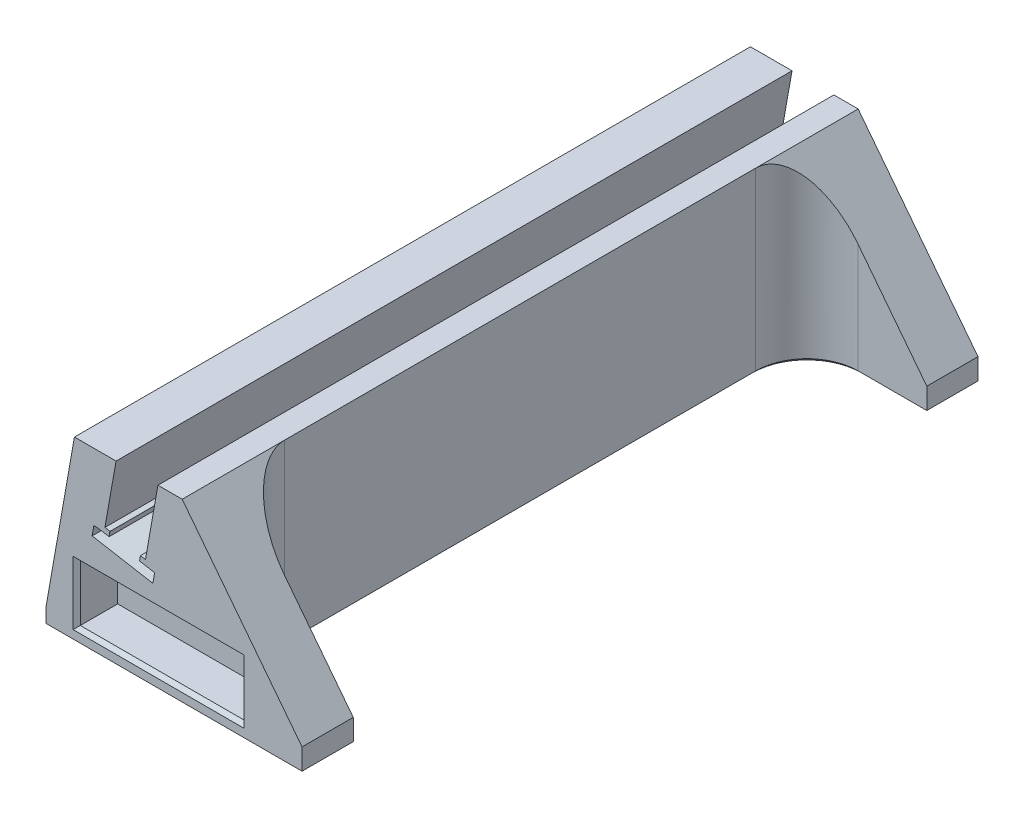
ISO-10303-21;
HEADER;
FILE_DESCRIPTION(('STEP AP214'),'2;1');
FILE_NAME('part.step','',(''),(''),'','','');
FILE_SCHEMA(('AUTOMOTIVE_DESIGN { 1 0 10303 214 1 1 1 1 }'));
ENDSEC;
DATA;
#1=APPLICATION_CONTEXT('core data for automotive mechanical design processes');
#2=APPLICATION_PROTOCOL_DEFINITION('international standard','automotive_design',2000,#1);
#3=PRODUCT_CONTEXT('',#1,'mechanical');
#4=PRODUCT('Part','Part','',(#3));
#5=PRODUCT_RELATED_PRODUCT_CATEGORY('part','',(#4));
#6=PRODUCT_DEFINITION_FORMATION('','',#4);
#7=PRODUCT_DEFINITION_CONTEXT('part definition',#1,'design');
#8=PRODUCT_DEFINITION('design','',#6,#7);
#9=PRODUCT_DEFINITION_SHAPE('','',#8);
#10=(LENGTH_UNIT() NAMED_UNIT(*) SI_UNIT(.MILLI.,.METRE.));
#11=(NAMED_UNIT(*) PLANE_ANGLE_UNIT() SI_UNIT($,.RADIAN.));
#12=(NAMED_UNIT(*) SI_UNIT($,.STERADIAN.) SOLID_ANGLE_UNIT());
#13=UNCERTAINTY_MEASURE_WITH_UNIT(LENGTH_MEASURE(1.E-05),#10,'distance_accuracy_value','');
#14=(GEOMETRIC_REPRESENTATION_CONTEXT(3) GLOBAL_UNCERTAINTY_ASSIGNED_CONTEXT((#13)) GLOBAL_UNIT_ASSIGNED_CONTEXT((#10,
#11,#12)) REPRESENTATION_CONTEXT('',''));
#15=CARTESIAN_POINT('',(0.,0.,0.));
#16=DIRECTION('',(0.,0.,1.));
#17=DIRECTION('',(1.,0.,0.));
#18=AXIS2_PLACEMENT_3D('',#15,#16,#17);
#19=CARTESIAN_POINT('',(25.,-15.1841895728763,132.));
#20=DIRECTION('',(-1.,0.,0.));
#21=DIRECTION('',(0.,0.,1.));
#22=AXIS2_PLACEMENT_3D('',#19,#20,#21);
#23=PLANE('',#22);
#24=DIRECTION('',(0.,1.,0.));
#25=VECTOR('',#24,1.);
#26=CARTESIAN_POINT('',(25.,-20.,10.));
#27=LINE('',#26,#25);
#28=CARTESIAN_POINT('',(25.,-19.3,10.));
#29=VERTEX_POINT('',#28);
#30=CARTESIAN_POINT('',(25.,-15.1841895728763,10.));
#31=VERTEX_POINT('',#30);
#32=EDGE_CURVE('E459',#29,#31,#27,.T.);
#33=ORIENTED_EDGE('',*,*,#32,.F.);
#34=DIRECTION('',(0.,0.,-1.));
#35=VECTOR('',#34,1.);
#36=CARTESIAN_POINT('',(25.,-19.3,132.));
#37=LINE('',#36,#35);
#38=CARTESIAN_POINT('',(25.,-19.3,0.));
#39=VERTEX_POINT('',#38);
#40=EDGE_CURVE('E774',#29,#39,#37,.T.);
#41=ORIENTED_EDGE('',*,*,#40,.T.);
#42=DIRECTION('',(0.,1.,0.));
#43=VECTOR('',#42,1.);
#44=CARTESIAN_POINT('',(25.,-15.1841895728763,0.));
#45=LINE('',#44,#43);
#46=CARTESIAN_POINT('',(25.,-15.1841895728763,0.));
#47=VERTEX_POINT('',#46);
#48=EDGE_CURVE('E536',#39,#47,#45,.T.);
#49=ORIENTED_EDGE('',*,*,#48,.T.);
#50=DIRECTION('',(0.,0.,-1.));
#51=VECTOR('',#50,1.);
#52=CARTESIAN_POINT('',(25.,-15.1841895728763,132.));
#53=LINE('',#52,#51);
#54=EDGE_CURVE('E630',#31,#47,#53,.T.);
#55=ORIENTED_EDGE('',*,*,#54,.F.);
#56=EDGE_LOOP('',(#33,#41,#49,#55));
#57=FACE_BOUND('',#56,.T.);
#58=ADVANCED_FACE('F40',(#57),#23,.F.);
#59=CARTESIAN_POINT('',(25.,-15.1841895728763,132.));
#60=DIRECTION('',(-0.790271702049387,-0.612756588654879,0.));
#61=DIRECTION('',(0.612756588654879,-0.790271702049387,0.));
#62=AXIS2_PLACEMENT_3D('',#59,#60,#61);
#63=PLANE('',#62);
#64=DIRECTION('',(0.,0.,-1.));
#65=VECTOR('',#64,1.);
#66=CARTESIAN_POINT('',(1.59594670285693,15.,132.));
#67=LINE('',#66,#65);
#68=CARTESIAN_POINT('',(1.59594670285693,15.,20.));
#69=VERTEX_POINT('',#68);
#70=CARTESIAN_POINT('',(1.59594670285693,15.,0.));
#71=VERTEX_POINT('',#70);
#72=EDGE_CURVE('E626',#69,#71,#67,.T.);
#73=ORIENTED_EDGE('',*,*,#72,.F.);
#74=CARTESIAN_POINT('',(11.5959467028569,2.10300767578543,20.));
#75=DIRECTION('',(-0.790271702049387,-0.612756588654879,0.));
#76=DIRECTION('',(0.612756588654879,-0.790271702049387,0.));
#77=AXIS2_PLACEMENT_3D('',#74,#75,#76);
#78=ELLIPSE('',#77,16.3196939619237,10.);
#79=CARTESIAN_POINT('',(11.5959467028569,2.10300767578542,9.99999999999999));
#80=VERTEX_POINT('',#79);
#81=EDGE_CURVE('E673',#69,#80,#78,.T.);
#82=ORIENTED_EDGE('',*,*,#81,.T.);
#83=DIRECTION('',(0.612756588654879,-0.790271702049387,0.));
#84=VECTOR('',#83,1.);
#85=CARTESIAN_POINT('',(25.,-15.1841895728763,9.99999999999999));
#86=LINE('',#85,#84);
#87=EDGE_CURVE('E651',#80,#31,#86,.T.);
#88=ORIENTED_EDGE('',*,*,#87,.T.);
#89=ORIENTED_EDGE('',*,*,#54,.T.);
#90=DIRECTION('',(-0.612756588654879,0.790271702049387,0.));
#91=VECTOR('',#90,1.);
#92=CARTESIAN_POINT('',(25.,-15.1841895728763,0.));
#93=LINE('',#92,#91);
#94=EDGE_CURVE('E539',#47,#71,#93,.T.);
#95=ORIENTED_EDGE('',*,*,#94,.T.);
#96=EDGE_LOOP('',(#73,#82,#88,#89,#95));
#97=FACE_BOUND('',#96,.T.);
#98=ADVANCED_FACE('F1068',(#97),#63,.F.);
#99=CARTESIAN_POINT('',(-11.3201608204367,15.,132.));
#100=DIRECTION('',(-0.984807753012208,0.17364817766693,0.));
#101=DIRECTION('',(-0.17364817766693,-0.984807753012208,0.));
#102=AXIS2_PLACEMENT_3D('',#99,#100,#101);
#103=PLANE('',#102);
#104=DIRECTION('',(0.17364817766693,0.984807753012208,0.));
#105=VECTOR('',#104,1.);
#106=CARTESIAN_POINT('',(-11.3201608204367,15.,0.));
#107=LINE('',#106,#105);
#108=CARTESIAN_POINT('',(-13.4913594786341,2.68652052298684,0.));
#109=VERTEX_POINT('',#108);
#110=CARTESIAN_POINT('',(-11.3201608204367,15.,0.));
#111=VERTEX_POINT('',#110);
#112=EDGE_CURVE('E462',#109,#111,#107,.T.);
#113=ORIENTED_EDGE('',*,*,#112,.T.);
#114=DIRECTION('',(0.,0.,-1.));
#115=VECTOR('',#114,1.);
#116=CARTESIAN_POINT('',(-11.3201608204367,15.,132.));
#117=LINE('',#116,#115);
#118=CARTESIAN_POINT('',(-11.3201608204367,15.,132.));
#119=VERTEX_POINT('',#118);
#120=EDGE_CURVE('E643',#119,#111,#117,.T.);
#121=ORIENTED_EDGE('',*,*,#120,.F.);
#122=DIRECTION('',(0.17364817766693,0.984807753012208,0.));
#123=VECTOR('',#122,1.);
#124=CARTESIAN_POINT('',(-11.3201608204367,15.,132.));
#125=LINE('',#124,#123);
#126=CARTESIAN_POINT('',(-13.4913594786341,2.68652052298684,132.));
#127=VERTEX_POINT('',#126);
#128=EDGE_CURVE('E465',#127,#119,#125,.T.);
#129=ORIENTED_EDGE('',*,*,#128,.F.);
#130=DIRECTION('',(0.,0.,-1.));
#131=VECTOR('',#130,1.);
#132=CARTESIAN_POINT('',(-13.4913594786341,2.68652052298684,132.));
#133=LINE('',#132,#131);
#134=EDGE_CURVE('E522',#127,#109,#133,.T.);
#135=ORIENTED_EDGE('',*,*,#134,.T.);
#136=EDGE_LOOP('',(#113,#121,#129,#135));
#137=FACE_BOUND('',#136,.T.);
#138=ADVANCED_FACE('F1051',(#137),#103,.F.);
#139=CARTESIAN_POINT('',(-19.4435737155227,15.,132.));
#140=DIRECTION('',(0.,-1.,0.));
#141=DIRECTION('',(0.,0.,-1.));
#142=AXIS2_PLACEMENT_3D('',#139,#140,#141);
#143=PLANE('',#142);
#144=DIRECTION('',(-1.,0.,0.));
#145=VECTOR('',#144,1.);
#146=CARTESIAN_POINT('',(-19.4435737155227,15.,0.));
#147=LINE('',#146,#145);
#148=CARTESIAN_POINT('',(-19.4435737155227,15.,0.));
#149=VERTEX_POINT('',#148);
#150=EDGE_CURVE('E526',#111,#149,#147,.T.);
#151=ORIENTED_EDGE('',*,*,#150,.T.);
#152=DIRECTION('',(0.,0.,-1.));
#153=VECTOR('',#152,1.);
#154=CARTESIAN_POINT('',(-19.4435737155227,15.,132.));
#155=LINE('',#154,#153);
#156=CARTESIAN_POINT('',(-19.4435737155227,15.,132.));
#157=VERTEX_POINT('',#156);
#158=EDGE_CURVE('E639',#157,#149,#155,.T.);
#159=ORIENTED_EDGE('',*,*,#158,.F.);
#160=DIRECTION('',(-1.,0.,0.));
#161=VECTOR('',#160,1.);
#162=CARTESIAN_POINT('',(-19.4435737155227,15.,132.));
#163=LINE('',#162,#161);
#164=EDGE_CURVE('E469',#119,#157,#163,.T.);
#165=ORIENTED_EDGE('',*,*,#164,.F.);
#166=ORIENTED_EDGE('',*,*,#120,.T.);
#167=EDGE_LOOP('',(#151,#159,#165,#166));
#168=FACE_BOUND('',#167,.T.);
#169=ADVANCED_FACE('F1054',(#168),#143,.F.);
#170=CARTESIAN_POINT('',(-19.4435737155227,15.,132.));
#171=DIRECTION('',(0.984807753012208,-0.173648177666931,0.));
#172=DIRECTION('',(0.173648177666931,0.984807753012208,0.));
#173=AXIS2_PLACEMENT_3D('',#170,#171,#172);
#174=PLANE('',#173);
#175=DIRECTION('',(-0.173648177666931,-0.984807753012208,0.));
#176=VECTOR('',#175,1.);
#177=CARTESIAN_POINT('',(-19.4435737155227,15.,0.));
#178=LINE('',#177,#176);
#179=CARTESIAN_POINT('',(-25.,-16.5120593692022,0.));
#180=VERTEX_POINT('',#179);
#181=EDGE_CURVE('E529',#149,#180,#178,.T.);
#182=ORIENTED_EDGE('',*,*,#181,.T.);
#183=DIRECTION('',(0.,0.,-1.));
#184=VECTOR('',#183,1.);
#185=CARTESIAN_POINT('',(-25.,-16.5120593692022,132.));
#186=LINE('',#185,#184);
#187=CARTESIAN_POINT('',(-25.,-16.5120593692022,132.));
#188=VERTEX_POINT('',#187);
#189=EDGE_CURVE('E635',#188,#180,#186,.T.);
#190=ORIENTED_EDGE('',*,*,#189,.F.);
#191=DIRECTION('',(-0.173648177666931,-0.984807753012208,0.));
#192=VECTOR('',#191,1.);
#193=CARTESIAN_POINT('',(-19.4435737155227,15.,132.));
#194=LINE('',#193,#192);
#195=EDGE_CURVE('E473',#157,#188,#194,.T.);
#196=ORIENTED_EDGE('',*,*,#195,.F.);
#197=ORIENTED_EDGE('',*,*,#158,.T.);
#198=EDGE_LOOP('',(#182,#190,#196,#197));
#199=FACE_BOUND('',#198,.T.);
#200=ADVANCED_FACE('F1057',(#199),#174,.F.);
#201=CARTESIAN_POINT('',(-25.,-16.5120593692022,132.));
#202=DIRECTION('',(1.,0.,0.));
#203=DIRECTION('',(0.,1.,0.));
#204=AXIS2_PLACEMENT_3D('',#201,#202,#203);
#205=PLANE('',#204);
#206=DIRECTION('',(0.,-1.,0.));
#207=VECTOR('',#206,1.);
#208=CARTESIAN_POINT('',(-25.,-16.5120593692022,0.));
#209=LINE('',#208,#207);
#210=CARTESIAN_POINT('',(-25.,-19.3,0.));
#211=VERTEX_POINT('',#210);
#212=EDGE_CURVE('E532',#180,#211,#209,.T.);
#213=ORIENTED_EDGE('',*,*,#212,.T.);
#214=DIRECTION('',(0.,0.,1.));
#215=VECTOR('',#214,1.);
#216=CARTESIAN_POINT('',(-25.,-19.3,132.));
#217=LINE('',#216,#215);
#218=CARTESIAN_POINT('',(-25.,-19.3,132.));
#219=VERTEX_POINT('',#218);
#220=EDGE_CURVE('E737',#211,#219,#217,.T.);
#221=ORIENTED_EDGE('',*,*,#220,.T.);
#222=DIRECTION('',(0.,-1.,0.));
#223=VECTOR('',#222,1.);
#224=CARTESIAN_POINT('',(-25.,-16.5120593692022,132.));
#225=LINE('',#224,#223);
#226=EDGE_CURVE('E476',#188,#219,#225,.T.);
#227=ORIENTED_EDGE('',*,*,#226,.F.);
#228=ORIENTED_EDGE('',*,*,#189,.T.);
#229=EDGE_LOOP('',(#213,#221,#227,#228));
#230=FACE_BOUND('',#229,.T.);
#231=ADVANCED_FACE('F943',(#230),#205,.F.);
#232=CARTESIAN_POINT('',(-25.,-20.,132.));
#233=DIRECTION('',(0.,1.,0.));
#234=DIRECTION('',(0.,0.,1.));
#235=AXIS2_PLACEMENT_3D('',#232,#233,#234);
#236=PLANE('',#235);
#237=DIRECTION('',(0.,0.,-1.));
#238=VECTOR('',#237,1.);
#239=CARTESIAN_POINT('',(-24.3,-20.,132.));
#240=LINE('',#239,#238);
#241=CARTESIAN_POINT('',(-24.3,-20.,131.3));
#242=VERTEX_POINT('',#241);
#243=CARTESIAN_POINT('',(-24.3,-20.,0.699999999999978));
#244=VERTEX_POINT('',#243);
#245=EDGE_CURVE('E713',#242,#244,#240,.T.);
#246=ORIENTED_EDGE('',*,*,#245,.T.);
#247=DIRECTION('',(1.,0.,0.));
#248=VECTOR('',#247,1.);
#249=CARTESIAN_POINT('',(-25.,-20.,0.699999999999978));
#250=LINE('',#249,#248);
#251=CARTESIAN_POINT('',(24.3,-20.,0.699999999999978));
#252=VERTEX_POINT('',#251);
#253=EDGE_CURVE('E716',#244,#252,#250,.T.);
#254=ORIENTED_EDGE('',*,*,#253,.T.);
#255=DIRECTION('',(0.,0.,1.));
#256=VECTOR('',#255,1.);
#257=CARTESIAN_POINT('',(24.3,-20.,132.));
#258=LINE('',#257,#256);
#259=CARTESIAN_POINT('',(24.3,-20.,9.30000000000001));
#260=VERTEX_POINT('',#259);
#261=EDGE_CURVE('E689',#252,#260,#258,.T.);
#262=ORIENTED_EDGE('',*,*,#261,.T.);
#263=DIRECTION('',(-1.,0.,0.));
#264=VECTOR('',#263,1.);
#265=CARTESIAN_POINT('',(-25.,-20.,9.3));
#266=LINE('',#265,#264);
#267=CARTESIAN_POINT('',(11.5959467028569,-20.,9.30000000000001));
#268=VERTEX_POINT('',#267);
#269=EDGE_CURVE('E692',#260,#268,#266,.T.);
#270=ORIENTED_EDGE('',*,*,#269,.T.);
#271=CARTESIAN_POINT('',(11.5959467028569,-20.,20.));
#272=DIRECTION('',(0.,1.,0.));
#273=DIRECTION('',(0.,0.,1.));
#274=AXIS2_PLACEMENT_3D('',#271,#272,#273);
#275=CIRCLE('',#274,10.7);
#276=CARTESIAN_POINT('',(0.895946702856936,-20.,20.));
#277=VERTEX_POINT('',#276);
#278=EDGE_CURVE('E695',#268,#277,#275,.T.);
#279=ORIENTED_EDGE('',*,*,#278,.T.);
#280=DIRECTION('',(0.,0.,1.));
#281=VECTOR('',#280,1.);
#282=CARTESIAN_POINT('',(0.895946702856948,-20.,132.));
#283=LINE('',#282,#281);
#284=CARTESIAN_POINT('',(0.895946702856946,-20.,112.));
#285=VERTEX_POINT('',#284);
#286=EDGE_CURVE('E698',#277,#285,#283,.T.);
#287=ORIENTED_EDGE('',*,*,#286,.T.);
#288=CARTESIAN_POINT('',(11.5959467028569,-20.,112.));
#289=DIRECTION('',(0.,1.,0.));
#290=DIRECTION('',(0.,0.,1.));
#291=AXIS2_PLACEMENT_3D('',#288,#289,#290);
#292=CIRCLE('',#291,10.7);
#293=CARTESIAN_POINT('',(11.5959467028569,-20.,122.7));
#294=VERTEX_POINT('',#293);
#295=EDGE_CURVE('E701',#285,#294,#292,.T.);
#296=ORIENTED_EDGE('',*,*,#295,.T.);
#297=DIRECTION('',(1.,0.,0.));
#298=VECTOR('',#297,1.);
#299=CARTESIAN_POINT('',(-25.,-20.,122.7));
#300=LINE('',#299,#298);
#301=CARTESIAN_POINT('',(24.3,-20.,122.7));
#302=VERTEX_POINT('',#301);
#303=EDGE_CURVE('E704',#294,#302,#300,.T.);
#304=ORIENTED_EDGE('',*,*,#303,.T.);
#305=DIRECTION('',(0.,0.,1.));
#306=VECTOR('',#305,1.);
#307=CARTESIAN_POINT('',(24.3,-20.,132.));
#308=LINE('',#307,#306);
#309=CARTESIAN_POINT('',(24.3,-20.,131.3));
#310=VERTEX_POINT('',#309);
#311=EDGE_CURVE('E707',#302,#310,#308,.T.);
#312=ORIENTED_EDGE('',*,*,#311,.T.);
#313=DIRECTION('',(-1.,0.,0.));
#314=VECTOR('',#313,1.);
#315=CARTESIAN_POINT('',(-25.,-20.,131.3));
#316=LINE('',#315,#314);
#317=EDGE_CURVE('E710',#310,#242,#316,.T.);
#318=ORIENTED_EDGE('',*,*,#317,.T.);
#319=EDGE_LOOP('',(#246,#254,#262,#270,#279,#287,#296,#304,#312,#318));
#320=FACE_BOUND('',#319,.T.);
#321=DIRECTION('',(1.,0.,0.));
#322=VECTOR('',#321,1.);
#323=CARTESIAN_POINT('',(-25.,-20.,121.7));
#324=LINE('',#323,#322);
#325=CARTESIAN_POINT('',(-21.7,-20.,121.7));
#326=VERTEX_POINT('',#325);
#327=CARTESIAN_POINT('',(-1.70405329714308,-20.,121.7));
#328=VERTEX_POINT('',#327);
#329=EDGE_CURVE('E682',#326,#328,#324,.T.);
#330=ORIENTED_EDGE('',*,*,#329,.T.);
#331=DIRECTION('',(0.,0.,-1.));
#332=VECTOR('',#331,1.);
#333=CARTESIAN_POINT('',(-1.70405329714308,-20.,132.));
#334=LINE('',#333,#332);
#335=CARTESIAN_POINT('',(-1.70405329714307,-20.,10.3));
#336=VERTEX_POINT('',#335);
#337=EDGE_CURVE('E685',#328,#336,#334,.T.);
#338=ORIENTED_EDGE('',*,*,#337,.T.);
#339=DIRECTION('',(-1.,0.,0.));
#340=VECTOR('',#339,1.);
#341=CARTESIAN_POINT('',(-25.,-20.,10.3));
#342=LINE('',#341,#340);
#343=CARTESIAN_POINT('',(-21.7,-20.,10.3));
#344=VERTEX_POINT('',#343);
#345=EDGE_CURVE('E676',#336,#344,#342,.T.);
#346=ORIENTED_EDGE('',*,*,#345,.T.);
#347=DIRECTION('',(0.,0.,1.));
#348=VECTOR('',#347,1.);
#349=CARTESIAN_POINT('',(-21.7,-20.,132.));
#350=LINE('',#349,#348);
#351=EDGE_CURVE('E679',#344,#326,#350,.T.);
#352=ORIENTED_EDGE('',*,*,#351,.T.);
#353=EDGE_LOOP('',(#330,#338,#346,#352));
#354=FACE_BOUND('',#353,.T.);
#355=ADVANCED_FACE('F934',(#320,#354),#236,.F.);
#356=DIRECTION('',(0.,1.,0.));
#357=VECTOR('',#356,1.);
#358=CARTESIAN_POINT('',(25.,-15.1841895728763,132.));
#359=LINE('',#358,#357);
#360=CARTESIAN_POINT('',(25.,-19.3,132.));
#361=VERTEX_POINT('',#360);
#362=CARTESIAN_POINT('',(25.,-15.1841895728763,132.));
#363=VERTEX_POINT('',#362);
#364=EDGE_CURVE('E480',#361,#363,#359,.T.);
#365=ORIENTED_EDGE('',*,*,#364,.F.);
#366=DIRECTION('',(0.,0.,-1.));
#367=VECTOR('',#366,1.);
#368=CARTESIAN_POINT('',(25.,-19.3,132.));
#369=LINE('',#368,#367);
#370=CARTESIAN_POINT('',(25.,-19.3,122.));
#371=VERTEX_POINT('',#370);
#372=EDGE_CURVE('E756',#361,#371,#369,.T.);
#373=ORIENTED_EDGE('',*,*,#372,.T.);
#374=DIRECTION('',(0.,1.,0.));
#375=VECTOR('',#374,1.);
#376=CARTESIAN_POINT('',(25.,-20.,122.));
#377=LINE('',#376,#375);
#378=CARTESIAN_POINT('',(25.,-15.1841895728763,122.));
#379=VERTEX_POINT('',#378);
#380=EDGE_CURVE('E458',#371,#379,#377,.T.);
#381=ORIENTED_EDGE('',*,*,#380,.T.);
#382=EDGE_CURVE('E631',#363,#379,#53,.T.);
#383=ORIENTED_EDGE('',*,*,#382,.F.);
#384=EDGE_LOOP('',(#365,#373,#381,#383));
#385=FACE_BOUND('',#384,.T.);
#386=ADVANCED_FACE('F959',(#385),#23,.F.);
#387=ORIENTED_EDGE('',*,*,#382,.T.);
#388=DIRECTION('',(-0.612756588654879,0.790271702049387,0.));
#389=VECTOR('',#388,1.);
#390=CARTESIAN_POINT('',(25.,-15.1841895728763,122.));
#391=LINE('',#390,#389);
#392=CARTESIAN_POINT('',(11.5959467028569,2.10300767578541,122.));
#393=VERTEX_POINT('',#392);
#394=EDGE_CURVE('E647',#379,#393,#391,.T.);
#395=ORIENTED_EDGE('',*,*,#394,.T.);
#396=CARTESIAN_POINT('',(11.5959467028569,2.10300767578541,112.));
#397=DIRECTION('',(-0.790271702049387,-0.612756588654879,0.));
#398=DIRECTION('',(0.612756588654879,-0.790271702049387,0.));
#399=AXIS2_PLACEMENT_3D('',#396,#397,#398);
#400=ELLIPSE('',#399,16.3196939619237,10.);
#401=CARTESIAN_POINT('',(1.59594670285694,15.,112.));
#402=VERTEX_POINT('',#401);
#403=EDGE_CURVE('E669',#393,#402,#400,.T.);
#404=ORIENTED_EDGE('',*,*,#403,.T.);
#405=CARTESIAN_POINT('',(1.59594670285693,15.,132.));
#406=VERTEX_POINT('',#405);
#407=EDGE_CURVE('E627',#406,#402,#67,.T.);
#408=ORIENTED_EDGE('',*,*,#407,.F.);
#409=DIRECTION('',(-0.612756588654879,0.790271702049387,0.));
#410=VECTOR('',#409,1.);
#411=CARTESIAN_POINT('',(25.,-15.1841895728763,132.));
#412=LINE('',#411,#410);
#413=EDGE_CURVE('E483',#363,#406,#412,.T.);
#414=ORIENTED_EDGE('',*,*,#413,.F.);
#415=EDGE_LOOP('',(#387,#395,#404,#408,#414));
#416=FACE_BOUND('',#415,.T.);
#417=ADVANCED_FACE('F988',(#416),#63,.F.);
#418=CARTESIAN_POINT('',(-3.14597659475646,15.,132.));
#419=DIRECTION('',(0.,-1.,0.));
#420=DIRECTION('',(0.,0.,-1.));
#421=AXIS2_PLACEMENT_3D('',#418,#419,#420);
#422=PLANE('',#421);
#423=DIRECTION('',(-1.,0.,0.));
#424=VECTOR('',#423,1.);
#425=CARTESIAN_POINT('',(-3.14597659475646,15.,0.));
#426=LINE('',#425,#424);
#427=CARTESIAN_POINT('',(-3.14597659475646,15.,0.));
#428=VERTEX_POINT('',#427);
#429=EDGE_CURVE('E543',#71,#428,#426,.T.);
#430=ORIENTED_EDGE('',*,*,#429,.T.);
#431=DIRECTION('',(0.,0.,-1.));
#432=VECTOR('',#431,1.);
#433=CARTESIAN_POINT('',(-3.14597659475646,15.,132.));
#434=LINE('',#433,#432);
#435=CARTESIAN_POINT('',(-3.14597659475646,15.,132.));
#436=VERTEX_POINT('',#435);
#437=EDGE_CURVE('E622',#436,#428,#434,.T.);
#438=ORIENTED_EDGE('',*,*,#437,.F.);
#439=DIRECTION('',(-1.,0.,0.));
#440=VECTOR('',#439,1.);
#441=CARTESIAN_POINT('',(-3.14597659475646,15.,132.));
#442=LINE('',#441,#440);
#443=EDGE_CURVE('E486',#406,#436,#442,.T.);
#444=ORIENTED_EDGE('',*,*,#443,.F.);
#445=ORIENTED_EDGE('',*,*,#407,.T.);
#446=DIRECTION('',(0.,0.,1.));
#447=VECTOR('',#446,1.);
#448=CARTESIAN_POINT('',(1.59594670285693,15.,9.99999999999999));
#449=LINE('',#448,#447);
#450=EDGE_CURVE('E443',#69,#402,#449,.T.);
#451=ORIENTED_EDGE('',*,*,#450,.F.);
#452=ORIENTED_EDGE('',*,*,#72,.T.);
#453=EDGE_LOOP('',(#430,#438,#444,#445,#451,#452));
#454=FACE_BOUND('',#453,.T.);
#455=ADVANCED_FACE('F994',(#454),#422,.F.);
#456=CARTESIAN_POINT('',(-5.57705108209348,1.21269145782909,132.));
#457=DIRECTION('',(0.984807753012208,-0.17364817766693,0.));
#458=DIRECTION('',(0.17364817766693,0.984807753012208,0.));
#459=AXIS2_PLACEMENT_3D('',#456,#457,#458);
#460=PLANE('',#459);
#461=DIRECTION('',(-0.17364817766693,-0.984807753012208,0.));
#462=VECTOR('',#461,1.);
#463=CARTESIAN_POINT('',(-5.57705108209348,1.21269145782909,0.));
#464=LINE('',#463,#462);
#465=CARTESIAN_POINT('',(-5.57705108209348,1.21269145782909,0.));
#466=VERTEX_POINT('',#465);
#467=EDGE_CURVE('E546',#428,#466,#464,.T.);
#468=ORIENTED_EDGE('',*,*,#467,.T.);
#469=DIRECTION('',(0.,0.,-1.));
#470=VECTOR('',#469,1.);
#471=CARTESIAN_POINT('',(-5.57705108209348,1.21269145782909,132.));
#472=LINE('',#471,#470);
#473=CARTESIAN_POINT('',(-5.57705108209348,1.21269145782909,132.));
#474=VERTEX_POINT('',#473);
#475=EDGE_CURVE('E618',#474,#466,#472,.T.);
#476=ORIENTED_EDGE('',*,*,#475,.F.);
#477=DIRECTION('',(-0.17364817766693,-0.984807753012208,0.));
#478=VECTOR('',#477,1.);
#479=CARTESIAN_POINT('',(-5.57705108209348,1.21269145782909,132.));
#480=LINE('',#479,#478);
#481=EDGE_CURVE('E489',#436,#474,#480,.T.);
#482=ORIENTED_EDGE('',*,*,#481,.F.);
#483=ORIENTED_EDGE('',*,*,#437,.T.);
#484=EDGE_LOOP('',(#468,#476,#482,#483));
#485=FACE_BOUND('',#484,.T.);
#486=ADVANCED_FACE('F997',(#485),#460,.F.);
#487=CARTESIAN_POINT('',(-5.57705108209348,1.21269145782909,132.));
#488=DIRECTION('',(-0.17364817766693,-0.984807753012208,0.));
#489=DIRECTION('',(0.984807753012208,-0.17364817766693,0.));
#490=AXIS2_PLACEMENT_3D('',#487,#488,#489);
#491=PLANE('',#490);
#492=DIRECTION('',(-0.984807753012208,0.17364817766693,0.));
#493=VECTOR('',#492,1.);
#494=CARTESIAN_POINT('',(-5.57705108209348,1.21269145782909,0.));
#495=LINE('',#494,#493);
#496=CARTESIAN_POINT('',(-6.56185883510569,1.38633963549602,0.));
#497=VERTEX_POINT('',#496);
#498=EDGE_CURVE('E549',#466,#497,#495,.T.);
#499=ORIENTED_EDGE('',*,*,#498,.T.);
#500=DIRECTION('',(0.,0.,-1.));
#501=VECTOR('',#500,1.);
#502=CARTESIAN_POINT('',(-6.56185883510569,1.38633963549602,132.));
#503=LINE('',#502,#501);
#504=CARTESIAN_POINT('',(-6.56185883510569,1.38633963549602,132.));
#505=VERTEX_POINT('',#504);
#506=EDGE_CURVE('E614',#505,#497,#503,.T.);
#507=ORIENTED_EDGE('',*,*,#506,.F.);
#508=DIRECTION('',(-0.984807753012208,0.17364817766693,0.));
#509=VECTOR('',#508,1.);
#510=CARTESIAN_POINT('',(-5.57705108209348,1.21269145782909,132.));
#511=LINE('',#510,#509);
#512=EDGE_CURVE('E492',#474,#505,#511,.T.);
#513=ORIENTED_EDGE('',*,*,#512,.F.);
#514=ORIENTED_EDGE('',*,*,#475,.T.);
#515=EDGE_LOOP('',(#499,#507,#513,#514));
#516=FACE_BOUND('',#515,.T.);
#517=ADVANCED_FACE('F1002',(#516),#491,.F.);
#518=CARTESIAN_POINT('',(-6.73550701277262,0.401531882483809,132.));
#519=DIRECTION('',(0.984807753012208,-0.173648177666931,0.));
#520=DIRECTION('',(0.173648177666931,0.984807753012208,0.));
#521=AXIS2_PLACEMENT_3D('',#518,#519,#520);
#522=PLANE('',#521);
#523=DIRECTION('',(-0.173648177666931,-0.984807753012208,0.));
#524=VECTOR('',#523,1.);
#525=CARTESIAN_POINT('',(-6.73550701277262,0.401531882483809,0.));
#526=LINE('',#525,#524);
#527=CARTESIAN_POINT('',(-6.73550701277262,0.401531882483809,0.));
#528=VERTEX_POINT('',#527);
#529=EDGE_CURVE('E552',#497,#528,#526,.T.);
#530=ORIENTED_EDGE('',*,*,#529,.T.);
#531=DIRECTION('',(0.,0.,-1.));
#532=VECTOR('',#531,1.);
#533=CARTESIAN_POINT('',(-6.73550701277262,0.401531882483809,132.));
#534=LINE('',#533,#532);
#535=CARTESIAN_POINT('',(-6.73550701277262,0.401531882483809,132.));
#536=VERTEX_POINT('',#535);
#537=EDGE_CURVE('E610',#536,#528,#534,.T.);
#538=ORIENTED_EDGE('',*,*,#537,.F.);
#539=DIRECTION('',(-0.173648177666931,-0.984807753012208,0.));
#540=VECTOR('',#539,1.);
#541=CARTESIAN_POINT('',(-6.73550701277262,0.401531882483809,132.));
#542=LINE('',#541,#540);
#543=EDGE_CURVE('E495',#505,#536,#542,.T.);
#544=ORIENTED_EDGE('',*,*,#543,.F.);
#545=ORIENTED_EDGE('',*,*,#506,.T.);
#546=EDGE_LOOP('',(#530,#538,#544,#545));
#547=FACE_BOUND('',#546,.T.);
#548=ADVANCED_FACE('F1008',(#547),#522,.F.);
#549=CARTESIAN_POINT('',(-5.75069925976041,0.227883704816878,132.));
#550=DIRECTION('',(0.173648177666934,0.984807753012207,0.));
#551=DIRECTION('',(-0.984807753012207,0.173648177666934,0.));
#552=AXIS2_PLACEMENT_3D('',#549,#550,#551);
#553=PLANE('',#552);
#554=DIRECTION('',(0.984807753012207,-0.173648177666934,0.));
#555=VECTOR('',#554,1.);
#556=CARTESIAN_POINT('',(-5.75069925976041,0.227883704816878,0.));
#557=LINE('',#556,#555);
#558=CARTESIAN_POINT('',(-3.781083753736,-0.119412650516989,0.));
#559=VERTEX_POINT('',#558);
#560=EDGE_CURVE('E556',#528,#559,#557,.T.);
#561=ORIENTED_EDGE('',*,*,#560,.T.);
#562=DIRECTION('',(0.,0.,-1.));
#563=VECTOR('',#562,1.);
#564=CARTESIAN_POINT('',(-3.781083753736,-0.119412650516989,132.));
#565=LINE('',#564,#563);
#566=CARTESIAN_POINT('',(-3.781083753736,-0.119412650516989,132.));
#567=VERTEX_POINT('',#566);
#568=EDGE_CURVE('E606',#567,#559,#565,.T.);
#569=ORIENTED_EDGE('',*,*,#568,.F.);
#570=DIRECTION('',(0.984807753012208,-0.173648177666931,0.));
#571=VECTOR('',#570,1.);
#572=CARTESIAN_POINT('',(-5.75069925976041,0.227883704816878,132.));
#573=LINE('',#572,#571);
#574=EDGE_CURVE('E498',#536,#567,#573,.T.);
#575=ORIENTED_EDGE('',*,*,#574,.F.);
#576=ORIENTED_EDGE('',*,*,#537,.T.);
#577=EDGE_LOOP('',(#561,#569,#575,#576));
#578=FACE_BOUND('',#577,.T.);
#579=ADVANCED_FACE('F1011',(#578),#553,.F.);
#580=CARTESIAN_POINT('',(-3.781083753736,-0.119412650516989,132.));
#581=DIRECTION('',(0.984807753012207,-0.173648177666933,0.));
#582=DIRECTION('',(0.173648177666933,0.984807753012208,0.));
#583=AXIS2_PLACEMENT_3D('',#580,#581,#582);
#584=PLANE('',#583);
#585=DIRECTION('',(-0.173648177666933,-0.984807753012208,0.));
#586=VECTOR('',#585,1.);
#587=CARTESIAN_POINT('',(-3.781083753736,-0.119412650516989,0.));
#588=LINE('',#587,#586);
#589=CARTESIAN_POINT('',(-4.12838010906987,-2.0890281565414,0.));
#590=VERTEX_POINT('',#589);
#591=EDGE_CURVE('E559',#559,#590,#588,.T.);
#592=ORIENTED_EDGE('',*,*,#591,.T.);
#593=DIRECTION('',(0.,0.,-1.));
#594=VECTOR('',#593,1.);
#595=CARTESIAN_POINT('',(-4.12838010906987,-2.0890281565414,132.));
#596=LINE('',#595,#594);
#597=CARTESIAN_POINT('',(-4.12838010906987,-2.0890281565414,132.));
#598=VERTEX_POINT('',#597);
#599=EDGE_CURVE('E602',#598,#590,#596,.T.);
#600=ORIENTED_EDGE('',*,*,#599,.F.);
#601=DIRECTION('',(-0.173648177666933,-0.984807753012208,0.));
#602=VECTOR('',#601,1.);
#603=CARTESIAN_POINT('',(-3.781083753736,-0.119412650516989,132.));
#604=LINE('',#603,#602);
#605=EDGE_CURVE('E501',#567,#598,#604,.T.);
#606=ORIENTED_EDGE('',*,*,#605,.F.);
#607=ORIENTED_EDGE('',*,*,#568,.T.);
#608=EDGE_LOOP('',(#592,#600,#606,#607));
#609=FACE_BOUND('',#608,.T.);
#610=ADVANCED_FACE('F1016',(#609),#584,.F.);
#611=CARTESIAN_POINT('',(-15.995313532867,0.00343238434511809,132.));
#612=DIRECTION('',(-0.173648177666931,-0.984807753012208,0.));
#613=DIRECTION('',(0.984807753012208,-0.173648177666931,0.));
#614=AXIS2_PLACEMENT_3D('',#611,#612,#613);
#615=PLANE('',#614);
#616=DIRECTION('',(-0.984807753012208,0.173648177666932,0.));
#617=VECTOR('',#616,1.);
#618=CARTESIAN_POINT('',(-15.995313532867,0.00343238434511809,0.));
#619=LINE('',#618,#617);
#620=CARTESIAN_POINT('',(-15.995313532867,0.00343238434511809,0.));
#621=VERTEX_POINT('',#620);
#622=EDGE_CURVE('E562',#590,#621,#619,.T.);
#623=ORIENTED_EDGE('',*,*,#622,.T.);
#624=DIRECTION('',(0.,0.,-1.));
#625=VECTOR('',#624,1.);
#626=CARTESIAN_POINT('',(-15.995313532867,0.00343238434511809,132.));
#627=LINE('',#626,#625);
#628=CARTESIAN_POINT('',(-15.995313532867,0.00343238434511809,132.));
#629=VERTEX_POINT('',#628);
#630=EDGE_CURVE('E598',#629,#621,#627,.T.);
#631=ORIENTED_EDGE('',*,*,#630,.F.);
#632=DIRECTION('',(-0.984807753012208,0.173648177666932,0.));
#633=VECTOR('',#632,1.);
#634=CARTESIAN_POINT('',(-15.995313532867,0.00343238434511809,132.));
#635=LINE('',#634,#633);
#636=EDGE_CURVE('E504',#598,#629,#635,.T.);
#637=ORIENTED_EDGE('',*,*,#636,.F.);
#638=ORIENTED_EDGE('',*,*,#599,.T.);
#639=EDGE_LOOP('',(#623,#631,#637,#638));
#640=FACE_BOUND('',#639,.T.);
#641=ADVANCED_FACE('F1022',(#640),#615,.F.);
#642=CARTESIAN_POINT('',(-15.6465519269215,1.97278896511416,132.));
#643=DIRECTION('',(-0.984678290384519,0.174380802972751,0.));
#644=DIRECTION('',(-0.174380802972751,-0.984678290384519,0.));
#645=AXIS2_PLACEMENT_3D('',#642,#643,#644);
#646=PLANE('',#645);
#647=DIRECTION('',(0.174380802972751,0.984678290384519,0.));
#648=VECTOR('',#647,1.);
#649=CARTESIAN_POINT('',(-15.6465519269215,1.97278896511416,0.));
#650=LINE('',#649,#648);
#651=CARTESIAN_POINT('',(-15.6465519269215,1.97278896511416,0.));
#652=VERTEX_POINT('',#651);
#653=EDGE_CURVE('E565',#621,#652,#650,.T.);
#654=ORIENTED_EDGE('',*,*,#653,.T.);
#655=DIRECTION('',(0.,0.,-1.));
#656=VECTOR('',#655,1.);
#657=CARTESIAN_POINT('',(-15.6465519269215,1.97278896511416,132.));
#658=LINE('',#657,#656);
#659=CARTESIAN_POINT('',(-15.6465519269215,1.97278896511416,132.));
#660=VERTEX_POINT('',#659);
#661=EDGE_CURVE('E594',#660,#652,#658,.T.);
#662=ORIENTED_EDGE('',*,*,#661,.F.);
#663=DIRECTION('',(0.174380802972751,0.984678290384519,0.));
#664=VECTOR('',#663,1.);
#665=CARTESIAN_POINT('',(-15.6465519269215,1.97278896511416,132.));
#666=LINE('',#665,#664);
#667=EDGE_CURVE('E507',#629,#660,#666,.T.);
#668=ORIENTED_EDGE('',*,*,#667,.F.);
#669=ORIENTED_EDGE('',*,*,#630,.T.);
#670=EDGE_LOOP('',(#654,#662,#668,#669));
#671=FACE_BOUND('',#670,.T.);
#672=ADVANCED_FACE('F1026',(#671),#646,.F.);
#673=CARTESIAN_POINT('',(-13.665007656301,1.70171276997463,132.));
#674=DIRECTION('',(0.135538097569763,0.990772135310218,0.));
#675=DIRECTION('',(-0.990772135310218,0.135538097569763,0.));
#676=AXIS2_PLACEMENT_3D('',#673,#674,#675);
#677=PLANE('',#676);
#678=DIRECTION('',(0.990772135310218,-0.135538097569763,0.));
#679=VECTOR('',#678,1.);
#680=CARTESIAN_POINT('',(-13.665007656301,1.70171276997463,0.));
#681=LINE('',#680,#679);
#682=CARTESIAN_POINT('',(-13.665007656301,1.70171276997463,0.));
#683=VERTEX_POINT('',#682);
#684=EDGE_CURVE('E568',#652,#683,#681,.T.);
#685=ORIENTED_EDGE('',*,*,#684,.T.);
#686=DIRECTION('',(0.,0.,-1.));
#687=VECTOR('',#686,1.);
#688=CARTESIAN_POINT('',(-13.665007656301,1.70171276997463,132.));
#689=LINE('',#688,#687);
#690=CARTESIAN_POINT('',(-13.665007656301,1.70171276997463,132.));
#691=VERTEX_POINT('',#690);
#692=EDGE_CURVE('E590',#691,#683,#689,.T.);
#693=ORIENTED_EDGE('',*,*,#692,.F.);
#694=DIRECTION('',(0.990772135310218,-0.135538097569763,0.));
#695=VECTOR('',#694,1.);
#696=CARTESIAN_POINT('',(-13.665007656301,1.70171276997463,132.));
#697=LINE('',#696,#695);
#698=EDGE_CURVE('E510',#660,#691,#697,.T.);
#699=ORIENTED_EDGE('',*,*,#698,.F.);
#700=ORIENTED_EDGE('',*,*,#661,.T.);
#701=EDGE_LOOP('',(#685,#693,#699,#700));
#702=FACE_BOUND('',#701,.T.);
#703=ADVANCED_FACE('F1031',(#702),#677,.F.);
#704=CARTESIAN_POINT('',(-13.665007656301,1.70171276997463,132.));
#705=DIRECTION('',(0.17364817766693,0.984807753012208,0.));
#706=DIRECTION('',(-0.984807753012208,0.17364817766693,0.));
#707=AXIS2_PLACEMENT_3D('',#704,#705,#706);
#708=PLANE('',#707);
#709=DIRECTION('',(0.984807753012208,-0.17364817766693,0.));
#710=VECTOR('',#709,1.);
#711=CARTESIAN_POINT('',(-13.665007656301,1.70171276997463,0.));
#712=LINE('',#711,#710);
#713=CARTESIAN_POINT('',(-12.6801999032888,1.5280645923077,0.));
#714=VERTEX_POINT('',#713);
#715=EDGE_CURVE('E571',#683,#714,#712,.T.);
#716=ORIENTED_EDGE('',*,*,#715,.T.);
#717=DIRECTION('',(0.,0.,-1.));
#718=VECTOR('',#717,1.);
#719=CARTESIAN_POINT('',(-12.6801999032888,1.5280645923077,132.));
#720=LINE('',#719,#718);
#721=CARTESIAN_POINT('',(-12.6801999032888,1.5280645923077,132.));
#722=VERTEX_POINT('',#721);
#723=EDGE_CURVE('E586',#722,#714,#720,.T.);
#724=ORIENTED_EDGE('',*,*,#723,.F.);
#725=DIRECTION('',(0.984807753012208,-0.17364817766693,0.));
#726=VECTOR('',#725,1.);
#727=CARTESIAN_POINT('',(-13.665007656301,1.70171276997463,132.));
#728=LINE('',#727,#726);
#729=EDGE_CURVE('E513',#691,#722,#728,.T.);
#730=ORIENTED_EDGE('',*,*,#729,.F.);
#731=ORIENTED_EDGE('',*,*,#692,.T.);
#732=EDGE_LOOP('',(#716,#724,#730,#731));
#733=FACE_BOUND('',#732,.T.);
#734=ADVANCED_FACE('F1037',(#733),#708,.F.);
#735=CARTESIAN_POINT('',(-12.6801999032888,1.5280645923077,132.));
#736=DIRECTION('',(-0.984807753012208,0.173648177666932,0.));
#737=DIRECTION('',(-0.173648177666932,-0.984807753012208,0.));
#738=AXIS2_PLACEMENT_3D('',#735,#736,#737);
#739=PLANE('',#738);
#740=DIRECTION('',(0.173648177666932,0.984807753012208,0.));
#741=VECTOR('',#740,1.);
#742=CARTESIAN_POINT('',(-12.6801999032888,1.5280645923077,0.));
#743=LINE('',#742,#741);
#744=CARTESIAN_POINT('',(-12.5065517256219,2.51287234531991,0.));
#745=VERTEX_POINT('',#744);
#746=EDGE_CURVE('E574',#714,#745,#743,.T.);
#747=ORIENTED_EDGE('',*,*,#746,.T.);
#748=DIRECTION('',(0.,0.,-1.));
#749=VECTOR('',#748,1.);
#750=CARTESIAN_POINT('',(-12.5065517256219,2.51287234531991,132.));
#751=LINE('',#750,#749);
#752=CARTESIAN_POINT('',(-12.5065517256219,2.51287234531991,132.));
#753=VERTEX_POINT('',#752);
#754=EDGE_CURVE('E582',#753,#745,#751,.T.);
#755=ORIENTED_EDGE('',*,*,#754,.F.);
#756=DIRECTION('',(0.173648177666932,0.984807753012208,0.));
#757=VECTOR('',#756,1.);
#758=CARTESIAN_POINT('',(-12.6801999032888,1.5280645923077,132.));
#759=LINE('',#758,#757);
#760=EDGE_CURVE('E516',#722,#753,#759,.T.);
#761=ORIENTED_EDGE('',*,*,#760,.F.);
#762=ORIENTED_EDGE('',*,*,#723,.T.);
#763=EDGE_LOOP('',(#747,#755,#761,#762));
#764=FACE_BOUND('',#763,.T.);
#765=ADVANCED_FACE('F1041',(#764),#739,.F.);
#766=CARTESIAN_POINT('',(-13.4913594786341,2.68652052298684,132.));
#767=DIRECTION('',(-0.17364817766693,-0.984807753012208,0.));
#768=DIRECTION('',(0.984807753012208,-0.17364817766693,0.));
#769=AXIS2_PLACEMENT_3D('',#766,#767,#768);
#770=PLANE('',#769);
#771=DIRECTION('',(-0.984807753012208,0.17364817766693,0.));
#772=VECTOR('',#771,1.);
#773=CARTESIAN_POINT('',(-13.4913594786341,2.68652052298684,0.));
#774=LINE('',#773,#772);
#775=EDGE_CURVE('E470',#745,#109,#774,.T.);
#776=ORIENTED_EDGE('',*,*,#775,.T.);
#777=ORIENTED_EDGE('',*,*,#134,.F.);
#778=DIRECTION('',(-0.984807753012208,0.17364817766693,0.));
#779=VECTOR('',#778,1.);
#780=CARTESIAN_POINT('',(-13.4913594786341,2.68652052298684,132.));
#781=LINE('',#780,#779);
#782=EDGE_CURVE('E519',#753,#127,#781,.T.);
#783=ORIENTED_EDGE('',*,*,#782,.F.);
#784=ORIENTED_EDGE('',*,*,#754,.T.);
#785=EDGE_LOOP('',(#776,#777,#783,#784));
#786=FACE_BOUND('',#785,.T.);
#787=ADVANCED_FACE('F1046',(#786),#770,.F.);
#788=CARTESIAN_POINT('',(0.,0.,132.));
#789=DIRECTION('',(0.,0.,1.));
#790=DIRECTION('',(1.,0.,0.));
#791=AXIS2_PLACEMENT_3D('',#788,#789,#790);
#792=PLANE('',#791);
#793=DIRECTION('',(0.,-1.,0.));
#794=VECTOR('',#793,1.);
#795=CARTESIAN_POINT('',(13.7,-17.,132.));
#796=LINE('',#795,#794);
#797=CARTESIAN_POINT('',(13.7,-5.3,132.));
#798=VERTEX_POINT('',#797);
#799=CARTESIAN_POINT('',(13.7,-17.7,132.));
#800=VERTEX_POINT('',#799);
#801=EDGE_CURVE('E746',#798,#800,#796,.T.);
#802=ORIENTED_EDGE('',*,*,#801,.T.);
#803=DIRECTION('',(-1.,0.,0.));
#804=VECTOR('',#803,1.);
#805=CARTESIAN_POINT('',(-19.,-17.7,132.));
#806=LINE('',#805,#804);
#807=CARTESIAN_POINT('',(-19.7,-17.7,132.));
#808=VERTEX_POINT('',#807);
#809=EDGE_CURVE('E749',#800,#808,#806,.T.);
#810=ORIENTED_EDGE('',*,*,#809,.T.);
#811=DIRECTION('',(0.,1.,0.));
#812=VECTOR('',#811,1.);
#813=CARTESIAN_POINT('',(-19.7,-6.00000000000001,132.));
#814=LINE('',#813,#812);
#815=CARTESIAN_POINT('',(-19.7,-5.3,132.));
#816=VERTEX_POINT('',#815);
#817=EDGE_CURVE('E743',#808,#816,#814,.T.);
#818=ORIENTED_EDGE('',*,*,#817,.T.);
#819=DIRECTION('',(1.,0.,0.));
#820=VECTOR('',#819,1.);
#821=CARTESIAN_POINT('',(13.,-5.3,132.));
#822=LINE('',#821,#820);
#823=EDGE_CURVE('E740',#816,#798,#822,.T.);
#824=ORIENTED_EDGE('',*,*,#823,.T.);
#825=EDGE_LOOP('',(#802,#810,#818,#824));
#826=FACE_BOUND('',#825,.T.);
#827=ORIENTED_EDGE('',*,*,#226,.T.);
#828=DIRECTION('',(1.,0.,0.));
#829=VECTOR('',#828,1.);
#830=CARTESIAN_POINT('',(25.,-19.3,132.));
#831=LINE('',#830,#829);
#832=EDGE_CURVE('E753',#219,#361,#831,.T.);
#833=ORIENTED_EDGE('',*,*,#832,.T.);
#834=ORIENTED_EDGE('',*,*,#364,.T.);
#835=ORIENTED_EDGE('',*,*,#413,.T.);
#836=ORIENTED_EDGE('',*,*,#443,.T.);
#837=ORIENTED_EDGE('',*,*,#481,.T.);
#838=ORIENTED_EDGE('',*,*,#512,.T.);
#839=ORIENTED_EDGE('',*,*,#543,.T.);
#840=ORIENTED_EDGE('',*,*,#574,.T.);
#841=ORIENTED_EDGE('',*,*,#605,.T.);
#842=ORIENTED_EDGE('',*,*,#636,.T.);
#843=ORIENTED_EDGE('',*,*,#667,.T.);
#844=ORIENTED_EDGE('',*,*,#698,.T.);
#845=ORIENTED_EDGE('',*,*,#729,.T.);
#846=ORIENTED_EDGE('',*,*,#760,.T.);
#847=ORIENTED_EDGE('',*,*,#782,.T.);
#848=ORIENTED_EDGE('',*,*,#128,.T.);
#849=ORIENTED_EDGE('',*,*,#164,.T.);
#850=ORIENTED_EDGE('',*,*,#195,.T.);
#851=EDGE_LOOP('',(#827,#833,#834,#835,#836,#837,#838,#839,#840,#841,#842,#843,#844,#845,#846,
#847,#848,#849,#850));
#852=FACE_BOUND('',#851,.T.);
#853=ADVANCED_FACE('F911',(#826,#852),#792,.T.);
#854=CARTESIAN_POINT('',(0.,0.,0.));
#855=DIRECTION('',(0.,0.,1.));
#856=DIRECTION('',(1.,0.,0.));
#857=AXIS2_PLACEMENT_3D('',#854,#855,#856);
#858=PLANE('',#857);
#859=DIRECTION('',(-1.,0.,0.));
#860=VECTOR('',#859,1.);
#861=CARTESIAN_POINT('',(0.,-5.30000000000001,0.));
#862=LINE('',#861,#860);
#863=CARTESIAN_POINT('',(13.7,-5.30000000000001,0.));
#864=VERTEX_POINT('',#863);
#865=CARTESIAN_POINT('',(-19.7,-5.30000000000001,0.));
#866=VERTEX_POINT('',#865);
#867=EDGE_CURVE('E720',#864,#866,#862,.T.);
#868=ORIENTED_EDGE('',*,*,#867,.T.);
#869=DIRECTION('',(0.,-1.,0.));
#870=VECTOR('',#869,1.);
#871=CARTESIAN_POINT('',(-19.7,0.,0.));
#872=LINE('',#871,#870);
#873=CARTESIAN_POINT('',(-19.7,-17.7,0.));
#874=VERTEX_POINT('',#873);
#875=EDGE_CURVE('E729',#866,#874,#872,.T.);
#876=ORIENTED_EDGE('',*,*,#875,.T.);
#877=DIRECTION('',(1.,0.,0.));
#878=VECTOR('',#877,1.);
#879=CARTESIAN_POINT('',(0.,-17.7,0.));
#880=LINE('',#879,#878);
#881=CARTESIAN_POINT('',(13.7,-17.7,0.));
#882=VERTEX_POINT('',#881);
#883=EDGE_CURVE('E726',#874,#882,#880,.T.);
#884=ORIENTED_EDGE('',*,*,#883,.T.);
#885=DIRECTION('',(0.,1.,0.));
#886=VECTOR('',#885,1.);
#887=CARTESIAN_POINT('',(13.7,0.,0.));
#888=LINE('',#887,#886);
#889=EDGE_CURVE('E723',#882,#864,#888,.T.);
#890=ORIENTED_EDGE('',*,*,#889,.T.);
#891=EDGE_LOOP('',(#868,#876,#884,#890));
#892=FACE_BOUND('',#891,.T.);
#893=ORIENTED_EDGE('',*,*,#48,.F.);
#894=DIRECTION('',(-1.,0.,0.));
#895=VECTOR('',#894,1.);
#896=CARTESIAN_POINT('',(0.,-19.3,0.));
#897=LINE('',#896,#895);
#898=EDGE_CURVE('E733',#39,#211,#897,.T.);
#899=ORIENTED_EDGE('',*,*,#898,.T.);
#900=ORIENTED_EDGE('',*,*,#212,.F.);
#901=ORIENTED_EDGE('',*,*,#181,.F.);
#902=ORIENTED_EDGE('',*,*,#150,.F.);
#903=ORIENTED_EDGE('',*,*,#112,.F.);
#904=ORIENTED_EDGE('',*,*,#775,.F.);
#905=ORIENTED_EDGE('',*,*,#746,.F.);
#906=ORIENTED_EDGE('',*,*,#715,.F.);
#907=ORIENTED_EDGE('',*,*,#684,.F.);
#908=ORIENTED_EDGE('',*,*,#653,.F.);
#909=ORIENTED_EDGE('',*,*,#622,.F.);
#910=ORIENTED_EDGE('',*,*,#591,.F.);
#911=ORIENTED_EDGE('',*,*,#560,.F.);
#912=ORIENTED_EDGE('',*,*,#529,.F.);
#913=ORIENTED_EDGE('',*,*,#498,.F.);
#914=ORIENTED_EDGE('',*,*,#467,.F.);
#915=ORIENTED_EDGE('',*,*,#429,.F.);
#916=ORIENTED_EDGE('',*,*,#94,.F.);
#917=EDGE_LOOP('',(#893,#899,#900,#901,#902,#903,#904,#905,#906,#907,#908,#909,#910,#911,#912,
#913,#914,#915,#916));
#918=FACE_BOUND('',#917,.T.);
#919=ADVANCED_FACE('F907',(#892,#918),#858,.F.);
#920=CARTESIAN_POINT('',(1.59594670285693,-20.,9.99999999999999));
#921=DIRECTION('',(0.,0.,-1.));
#922=DIRECTION('',(-1.,0.,0.));
#923=AXIS2_PLACEMENT_3D('',#920,#921,#922);
#924=PLANE('',#923);
#925=DIRECTION('',(0.,1.,0.));
#926=VECTOR('',#925,1.);
#927=CARTESIAN_POINT('',(11.5959467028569,-20.,10.));
#928=LINE('',#927,#926);
#929=CARTESIAN_POINT('',(11.5959467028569,-19.3,10.));
#930=VERTEX_POINT('',#929);
#931=EDGE_CURVE('E665',#80,#930,#928,.F.);
#932=ORIENTED_EDGE('',*,*,#931,.T.);
#933=DIRECTION('',(1.,0.,0.));
#934=VECTOR('',#933,1.);
#935=CARTESIAN_POINT('',(1.59594670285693,-19.3,9.99999999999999));
#936=LINE('',#935,#934);
#937=EDGE_CURVE('E771',#930,#29,#936,.T.);
#938=ORIENTED_EDGE('',*,*,#937,.T.);
#939=ORIENTED_EDGE('',*,*,#32,.T.);
#940=ORIENTED_EDGE('',*,*,#87,.F.);
#941=EDGE_LOOP('',(#932,#938,#939,#940));
#942=FACE_BOUND('',#941,.T.);
#943=ADVANCED_FACE('F910',(#942),#924,.F.);
#944=CARTESIAN_POINT('',(1.59594670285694,-20.,122.));
#945=DIRECTION('',(0.,0.,1.));
#946=DIRECTION('',(1.,0.,0.));
#947=AXIS2_PLACEMENT_3D('',#944,#945,#946);
#948=PLANE('',#947);
#949=ORIENTED_EDGE('',*,*,#380,.F.);
#950=DIRECTION('',(-1.,0.,0.));
#951=VECTOR('',#950,1.);
#952=CARTESIAN_POINT('',(1.59594670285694,-19.3,122.));
#953=LINE('',#952,#951);
#954=CARTESIAN_POINT('',(11.5959467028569,-19.3,122.));
#955=VERTEX_POINT('',#954);
#956=EDGE_CURVE('E759',#371,#955,#953,.T.);
#957=ORIENTED_EDGE('',*,*,#956,.T.);
#958=DIRECTION('',(0.,1.,0.));
#959=VECTOR('',#958,1.);
#960=CARTESIAN_POINT('',(11.5959467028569,15.,122.));
#961=LINE('',#960,#959);
#962=EDGE_CURVE('E655',#955,#393,#961,.T.);
#963=ORIENTED_EDGE('',*,*,#962,.T.);
#964=ORIENTED_EDGE('',*,*,#394,.F.);
#965=EDGE_LOOP('',(#949,#957,#963,#964));
#966=FACE_BOUND('',#965,.T.);
#967=ADVANCED_FACE('F964',(#966),#948,.F.);
#968=CARTESIAN_POINT('',(1.59594670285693,-20.,9.99999999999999));
#969=DIRECTION('',(-1.,0.,0.));
#970=DIRECTION('',(0.,0.,1.));
#971=AXIS2_PLACEMENT_3D('',#968,#969,#970);
#972=PLANE('',#971);
#973=DIRECTION('',(0.,1.,0.));
#974=VECTOR('',#973,1.);
#975=CARTESIAN_POINT('',(1.59594670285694,-20.,112.));
#976=LINE('',#975,#974);
#977=CARTESIAN_POINT('',(1.59594670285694,-19.3,112.));
#978=VERTEX_POINT('',#977);
#979=EDGE_CURVE('E661',#402,#978,#976,.F.);
#980=ORIENTED_EDGE('',*,*,#979,.T.);
#981=DIRECTION('',(0.,0.,-1.));
#982=VECTOR('',#981,1.);
#983=CARTESIAN_POINT('',(1.59594670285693,-19.3,9.99999999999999));
#984=LINE('',#983,#982);
#985=CARTESIAN_POINT('',(1.59594670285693,-19.3,20.));
#986=VERTEX_POINT('',#985);
#987=EDGE_CURVE('E765',#978,#986,#984,.T.);
#988=ORIENTED_EDGE('',*,*,#987,.T.);
#989=DIRECTION('',(0.,1.,0.));
#990=VECTOR('',#989,1.);
#991=CARTESIAN_POINT('',(1.59594670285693,15.,20.));
#992=LINE('',#991,#990);
#993=EDGE_CURVE('E658',#986,#69,#992,.T.);
#994=ORIENTED_EDGE('',*,*,#993,.T.);
#995=ORIENTED_EDGE('',*,*,#450,.T.);
#996=EDGE_LOOP('',(#980,#988,#994,#995));
#997=FACE_BOUND('',#996,.T.);
#998=ADVANCED_FACE('F981',(#997),#972,.F.);
#999=CARTESIAN_POINT('',(11.5959467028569,-20.,112.));
#1000=DIRECTION('',(0.,-1.,0.));
#1001=DIRECTION('',(0.,0.,-1.));
#1002=AXIS2_PLACEMENT_3D('',#999,#1000,#1001);
#1003=CYLINDRICAL_SURFACE('',#1002,10.);
#1004=ORIENTED_EDGE('',*,*,#962,.F.);
#1005=CARTESIAN_POINT('',(11.5959467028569,-19.3,112.));
#1006=DIRECTION('',(0.,1.,0.));
#1007=DIRECTION('',(0.,0.,1.));
#1008=AXIS2_PLACEMENT_3D('',#1005,#1006,#1007);
#1009=CIRCLE('',#1008,10.);
#1010=EDGE_CURVE('E762',#955,#978,#1009,.F.);
#1011=ORIENTED_EDGE('',*,*,#1010,.T.);
#1012=ORIENTED_EDGE('',*,*,#979,.F.);
#1013=ORIENTED_EDGE('',*,*,#403,.F.);
#1014=EDGE_LOOP('',(#1004,#1011,#1012,#1013));
#1015=FACE_BOUND('',#1014,.T.);
#1016=ADVANCED_FACE('F978',(#1015),#1003,.F.);
#1017=CARTESIAN_POINT('',(11.5959467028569,-20.,20.));
#1018=DIRECTION('',(0.,-1.,0.));
#1019=DIRECTION('',(0.,0.,-1.));
#1020=AXIS2_PLACEMENT_3D('',#1017,#1018,#1019);
#1021=CYLINDRICAL_SURFACE('',#1020,10.);
#1022=ORIENTED_EDGE('',*,*,#993,.F.);
#1023=CARTESIAN_POINT('',(11.5959467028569,-19.3,20.));
#1024=DIRECTION('',(0.,1.,0.));
#1025=DIRECTION('',(0.,0.,1.));
#1026=AXIS2_PLACEMENT_3D('',#1023,#1024,#1025);
#1027=CIRCLE('',#1026,10.);
#1028=EDGE_CURVE('E768',#986,#930,#1027,.F.);
#1029=ORIENTED_EDGE('',*,*,#1028,.T.);
#1030=ORIENTED_EDGE('',*,*,#931,.F.);
#1031=ORIENTED_EDGE('',*,*,#81,.F.);
#1032=EDGE_LOOP('',(#1022,#1029,#1030,#1031));
#1033=FACE_BOUND('',#1032,.T.);
#1034=ADVANCED_FACE('F1245',(#1033),#1021,.F.);
#1035=CARTESIAN_POINT('',(-19.,-6.00000000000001,124.));
#1036=DIRECTION('',(-1.,0.,0.));
#1037=DIRECTION('',(0.,0.,1.));
#1038=AXIS2_PLACEMENT_3D('',#1035,#1036,#1037);
#1039=PLANE('',#1038);
#1040=DIRECTION('',(0.,0.,1.));
#1041=VECTOR('',#1040,1.);
#1042=CARTESIAN_POINT('',(-19.,-6.00000000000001,124.));
#1043=LINE('',#1042,#1041);
#1044=CARTESIAN_POINT('',(-19.,-6.00000000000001,124.));
#1045=VERTEX_POINT('',#1044);
#1046=CARTESIAN_POINT('',(-19.,-6.00000000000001,131.3));
#1047=VERTEX_POINT('',#1046);
#1048=EDGE_CURVE('E439',#1045,#1047,#1043,.T.);
#1049=ORIENTED_EDGE('',*,*,#1048,.T.);
#1050=DIRECTION('',(0.,-1.,0.));
#1051=VECTOR('',#1050,1.);
#1052=CARTESIAN_POINT('',(-19.,-17.,131.3));
#1053=LINE('',#1052,#1051);
#1054=CARTESIAN_POINT('',(-19.,-17.,131.3));
#1055=VERTEX_POINT('',#1054);
#1056=EDGE_CURVE('E796',#1047,#1055,#1053,.T.);
#1057=ORIENTED_EDGE('',*,*,#1056,.T.);
#1058=DIRECTION('',(0.,0.,1.));
#1059=VECTOR('',#1058,1.);
#1060=CARTESIAN_POINT('',(-19.,-17.,124.));
#1061=LINE('',#1060,#1059);
#1062=CARTESIAN_POINT('',(-19.,-17.,124.));
#1063=VERTEX_POINT('',#1062);
#1064=EDGE_CURVE('E438',#1063,#1055,#1061,.T.);
#1065=ORIENTED_EDGE('',*,*,#1064,.F.);
#1066=DIRECTION('',(0.,-1.,0.));
#1067=VECTOR('',#1066,1.);
#1068=CARTESIAN_POINT('',(-19.,-6.00000000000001,124.));
#1069=LINE('',#1068,#1067);
#1070=EDGE_CURVE('E414',#1045,#1063,#1069,.T.);
#1071=ORIENTED_EDGE('',*,*,#1070,.F.);
#1072=EDGE_LOOP('',(#1049,#1057,#1065,#1071));
#1073=FACE_BOUND('',#1072,.T.);
#1074=ADVANCED_FACE('F1253',(#1073),#1039,.F.);
#1075=CARTESIAN_POINT('',(-19.,-6.00000000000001,124.));
#1076=DIRECTION('',(0.,1.,0.));
#1077=DIRECTION('',(0.,0.,1.));
#1078=AXIS2_PLACEMENT_3D('',#1075,#1076,#1077);
#1079=PLANE('',#1078);
#1080=DIRECTION('',(0.,0.,1.));
#1081=VECTOR('',#1080,1.);
#1082=CARTESIAN_POINT('',(13.,-6.00000000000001,124.));
#1083=LINE('',#1082,#1081);
#1084=CARTESIAN_POINT('',(13.,-6.00000000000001,124.));
#1085=VERTEX_POINT('',#1084);
#1086=CARTESIAN_POINT('',(13.,-6.00000000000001,131.3));
#1087=VERTEX_POINT('',#1086);
#1088=EDGE_CURVE('E444',#1085,#1087,#1083,.T.);
#1089=ORIENTED_EDGE('',*,*,#1088,.T.);
#1090=DIRECTION('',(-1.,0.,0.));
#1091=VECTOR('',#1090,1.);
#1092=CARTESIAN_POINT('',(-19.,-6.00000000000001,131.3));
#1093=LINE('',#1092,#1091);
#1094=EDGE_CURVE('E799',#1087,#1047,#1093,.T.);
#1095=ORIENTED_EDGE('',*,*,#1094,.T.);
#1096=ORIENTED_EDGE('',*,*,#1048,.F.);
#1097=DIRECTION('',(-1.,0.,0.));
#1098=VECTOR('',#1097,1.);
#1099=CARTESIAN_POINT('',(-19.,-6.00000000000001,124.));
#1100=LINE('',#1099,#1098);
#1101=EDGE_CURVE('E434',#1085,#1045,#1100,.T.);
#1102=ORIENTED_EDGE('',*,*,#1101,.F.);
#1103=EDGE_LOOP('',(#1089,#1095,#1096,#1102));
#1104=FACE_BOUND('',#1103,.T.);
#1105=ADVANCED_FACE('F1262',(#1104),#1079,.F.);
#1106=CARTESIAN_POINT('',(13.,-6.00000000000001,124.));
#1107=DIRECTION('',(1.,0.,0.));
#1108=DIRECTION('',(0.,1.,0.));
#1109=AXIS2_PLACEMENT_3D('',#1106,#1107,#1108);
#1110=PLANE('',#1109);
#1111=DIRECTION('',(0.,0.,1.));
#1112=VECTOR('',#1111,1.);
#1113=CARTESIAN_POINT('',(13.,-17.,124.));
#1114=LINE('',#1113,#1112);
#1115=CARTESIAN_POINT('',(13.,-17.,124.));
#1116=VERTEX_POINT('',#1115);
#1117=CARTESIAN_POINT('',(13.,-17.,131.3));
#1118=VERTEX_POINT('',#1117);
#1119=EDGE_CURVE('E448',#1116,#1118,#1114,.T.);
#1120=ORIENTED_EDGE('',*,*,#1119,.T.);
#1121=DIRECTION('',(0.,1.,0.));
#1122=VECTOR('',#1121,1.);
#1123=CARTESIAN_POINT('',(13.,-6.00000000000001,131.3));
#1124=LINE('',#1123,#1122);
#1125=EDGE_CURVE('E793',#1118,#1087,#1124,.T.);
#1126=ORIENTED_EDGE('',*,*,#1125,.T.);
#1127=ORIENTED_EDGE('',*,*,#1088,.F.);
#1128=DIRECTION('',(0.,1.,0.));
#1129=VECTOR('',#1128,1.);
#1130=CARTESIAN_POINT('',(13.,-6.00000000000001,124.));
#1131=LINE('',#1130,#1129);
#1132=EDGE_CURVE('E430',#1116,#1085,#1131,.T.);
#1133=ORIENTED_EDGE('',*,*,#1132,.F.);
#1134=EDGE_LOOP('',(#1120,#1126,#1127,#1133));
#1135=FACE_BOUND('',#1134,.T.);
#1136=ADVANCED_FACE('F1271',(#1135),#1110,.F.);
#1137=CARTESIAN_POINT('',(-19.,-17.,124.));
#1138=DIRECTION('',(0.,-1.,0.));
#1139=DIRECTION('',(0.,0.,-1.));
#1140=AXIS2_PLACEMENT_3D('',#1137,#1138,#1139);
#1141=PLANE('',#1140);
#1142=ORIENTED_EDGE('',*,*,#1064,.T.);
#1143=DIRECTION('',(1.,0.,0.));
#1144=VECTOR('',#1143,1.);
#1145=CARTESIAN_POINT('',(13.,-17.,131.3));
#1146=LINE('',#1145,#1144);
#1147=EDGE_CURVE('E789',#1055,#1118,#1146,.T.);
#1148=ORIENTED_EDGE('',*,*,#1147,.T.);
#1149=ORIENTED_EDGE('',*,*,#1119,.F.);
#1150=DIRECTION('',(1.,0.,0.));
#1151=VECTOR('',#1150,1.);
#1152=CARTESIAN_POINT('',(-19.,-17.,124.));
#1153=LINE('',#1152,#1151);
#1154=EDGE_CURVE('E426',#1063,#1116,#1153,.T.);
#1155=ORIENTED_EDGE('',*,*,#1154,.F.);
#1156=EDGE_LOOP('',(#1142,#1148,#1149,#1155));
#1157=FACE_BOUND('',#1156,.T.);
#1158=ADVANCED_FACE('F1280',(#1157),#1141,.F.);
#1159=CARTESIAN_POINT('',(0.,0.,124.));
#1160=DIRECTION('',(0.,0.,1.));
#1161=DIRECTION('',(1.,0.,0.));
#1162=AXIS2_PLACEMENT_3D('',#1159,#1160,#1161);
#1163=PLANE('',#1162);
#1164=ORIENTED_EDGE('',*,*,#1070,.T.);
#1165=ORIENTED_EDGE('',*,*,#1154,.T.);
#1166=ORIENTED_EDGE('',*,*,#1132,.T.);
#1167=ORIENTED_EDGE('',*,*,#1101,.T.);
#1168=EDGE_LOOP('',(#1164,#1165,#1166,#1167));
#1169=FACE_BOUND('',#1168,.T.);
#1170=ADVANCED_FACE('F1289',(#1169),#1163,.T.);
#1171=CARTESIAN_POINT('',(-19.,-6.00000000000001,0.));
#1172=DIRECTION('',(-1.,0.,0.));
#1173=DIRECTION('',(0.,0.,1.));
#1174=AXIS2_PLACEMENT_3D('',#1171,#1172,#1173);
#1175=PLANE('',#1174);
#1176=DIRECTION('',(0.,0.,1.));
#1177=VECTOR('',#1176,1.);
#1178=CARTESIAN_POINT('',(-19.,-17.,0.));
#1179=LINE('',#1178,#1177);
#1180=CARTESIAN_POINT('',(-19.,-17.,0.700000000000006));
#1181=VERTEX_POINT('',#1180);
#1182=CARTESIAN_POINT('',(-19.,-17.,8.00000000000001));
#1183=VERTEX_POINT('',#1182);
#1184=EDGE_CURVE('E410',#1181,#1183,#1179,.T.);
#1185=ORIENTED_EDGE('',*,*,#1184,.F.);
#1186=DIRECTION('',(0.,1.,0.));
#1187=VECTOR('',#1186,1.);
#1188=CARTESIAN_POINT('',(-19.,-6.00000000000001,0.700000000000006));
#1189=LINE('',#1188,#1187);
#1190=CARTESIAN_POINT('',(-19.,-6.00000000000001,0.700000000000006));
#1191=VERTEX_POINT('',#1190);
#1192=EDGE_CURVE('E802',#1181,#1191,#1189,.T.);
#1193=ORIENTED_EDGE('',*,*,#1192,.T.);
#1194=DIRECTION('',(0.,0.,1.));
#1195=VECTOR('',#1194,1.);
#1196=CARTESIAN_POINT('',(-19.,-6.00000000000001,0.));
#1197=LINE('',#1196,#1195);
#1198=CARTESIAN_POINT('',(-19.,-6.00000000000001,8.00000000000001));
#1199=VERTEX_POINT('',#1198);
#1200=EDGE_CURVE('E411',#1191,#1199,#1197,.T.);
#1201=ORIENTED_EDGE('',*,*,#1200,.T.);
#1202=DIRECTION('',(0.,-1.,0.));
#1203=VECTOR('',#1202,1.);
#1204=CARTESIAN_POINT('',(-19.,-6.00000000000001,8.00000000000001));
#1205=LINE('',#1204,#1203);
#1206=EDGE_CURVE('E388',#1199,#1183,#1205,.T.);
#1207=ORIENTED_EDGE('',*,*,#1206,.T.);
#1208=EDGE_LOOP('',(#1185,#1193,#1201,#1207));
#1209=FACE_BOUND('',#1208,.T.);
#1210=ADVANCED_FACE('F901',(#1209),#1175,.F.);
#1211=CARTESIAN_POINT('',(-19.,-6.00000000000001,0.));
#1212=DIRECTION('',(0.,1.,0.));
#1213=DIRECTION('',(0.,0.,1.));
#1214=AXIS2_PLACEMENT_3D('',#1211,#1212,#1213);
#1215=PLANE('',#1214);
#1216=ORIENTED_EDGE('',*,*,#1200,.F.);
#1217=DIRECTION('',(1.,0.,0.));
#1218=VECTOR('',#1217,1.);
#1219=CARTESIAN_POINT('',(-19.,-6.00000000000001,0.700000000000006));
#1220=LINE('',#1219,#1218);
#1221=CARTESIAN_POINT('',(13.,-6.00000000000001,0.700000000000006));
#1222=VERTEX_POINT('',#1221);
#1223=EDGE_CURVE('E11',#1191,#1222,#1220,.T.);
#1224=ORIENTED_EDGE('',*,*,#1223,.T.);
#1225=DIRECTION('',(0.,0.,1.));
#1226=VECTOR('',#1225,1.);
#1227=CARTESIAN_POINT('',(13.,-6.00000000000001,0.));
#1228=LINE('',#1227,#1226);
#1229=CARTESIAN_POINT('',(13.,-6.00000000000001,8.00000000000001));
#1230=VERTEX_POINT('',#1229);
#1231=EDGE_CURVE('E415',#1222,#1230,#1228,.T.);
#1232=ORIENTED_EDGE('',*,*,#1231,.T.);
#1233=DIRECTION('',(-1.,0.,0.));
#1234=VECTOR('',#1233,1.);
#1235=CARTESIAN_POINT('',(-19.,-6.00000000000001,8.00000000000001));
#1236=LINE('',#1235,#1234);
#1237=EDGE_CURVE('E406',#1230,#1199,#1236,.T.);
#1238=ORIENTED_EDGE('',*,*,#1237,.T.);
#1239=EDGE_LOOP('',(#1216,#1224,#1232,#1238));
#1240=FACE_BOUND('',#1239,.T.);
#1241=ADVANCED_FACE('F1307',(#1240),#1215,.F.);
#1242=CARTESIAN_POINT('',(13.,-6.00000000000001,0.));
#1243=DIRECTION('',(1.,0.,0.));
#1244=DIRECTION('',(0.,1.,0.));
#1245=AXIS2_PLACEMENT_3D('',#1242,#1243,#1244);
#1246=PLANE('',#1245);
#1247=ORIENTED_EDGE('',*,*,#1231,.F.);
#1248=DIRECTION('',(0.,-1.,0.));
#1249=VECTOR('',#1248,1.);
#1250=CARTESIAN_POINT('',(13.,-6.00000000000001,0.700000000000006));
#1251=LINE('',#1250,#1249);
#1252=CARTESIAN_POINT('',(13.,-17.,0.700000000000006));
#1253=VERTEX_POINT('',#1252);
#1254=EDGE_CURVE('E50',#1222,#1253,#1251,.T.);
#1255=ORIENTED_EDGE('',*,*,#1254,.T.);
#1256=DIRECTION('',(0.,0.,1.));
#1257=VECTOR('',#1256,1.);
#1258=CARTESIAN_POINT('',(13.,-17.,0.));
#1259=LINE('',#1258,#1257);
#1260=CARTESIAN_POINT('',(13.,-17.,8.00000000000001));
#1261=VERTEX_POINT('',#1260);
#1262=EDGE_CURVE('E418',#1253,#1261,#1259,.T.);
#1263=ORIENTED_EDGE('',*,*,#1262,.T.);
#1264=DIRECTION('',(0.,1.,0.));
#1265=VECTOR('',#1264,1.);
#1266=CARTESIAN_POINT('',(13.,-6.00000000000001,8.00000000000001));
#1267=LINE('',#1266,#1265);
#1268=EDGE_CURVE('E402',#1261,#1230,#1267,.T.);
#1269=ORIENTED_EDGE('',*,*,#1268,.T.);
#1270=EDGE_LOOP('',(#1247,#1255,#1263,#1269));
#1271=FACE_BOUND('',#1270,.T.);
#1272=ADVANCED_FACE('F1315',(#1271),#1246,.F.);
#1273=CARTESIAN_POINT('',(-19.,-17.,0.));
#1274=DIRECTION('',(0.,-1.,0.));
#1275=DIRECTION('',(0.,0.,-1.));
#1276=AXIS2_PLACEMENT_3D('',#1273,#1274,#1275);
#1277=PLANE('',#1276);
#1278=ORIENTED_EDGE('',*,*,#1262,.F.);
#1279=DIRECTION('',(-1.,0.,0.));
#1280=VECTOR('',#1279,1.);
#1281=CARTESIAN_POINT('',(-19.,-17.,0.700000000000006));
#1282=LINE('',#1281,#1280);
#1283=EDGE_CURVE('E806',#1253,#1181,#1282,.T.);
#1284=ORIENTED_EDGE('',*,*,#1283,.T.);
#1285=ORIENTED_EDGE('',*,*,#1184,.T.);
#1286=DIRECTION('',(1.,0.,0.));
#1287=VECTOR('',#1286,1.);
#1288=CARTESIAN_POINT('',(-19.,-17.,8.00000000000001));
#1289=LINE('',#1288,#1287);
#1290=EDGE_CURVE('E398',#1183,#1261,#1289,.T.);
#1291=ORIENTED_EDGE('',*,*,#1290,.T.);
#1292=EDGE_LOOP('',(#1278,#1284,#1285,#1291));
#1293=FACE_BOUND('',#1292,.T.);
#1294=ADVANCED_FACE('F897',(#1293),#1277,.F.);
#1295=CARTESIAN_POINT('',(0.,0.,8.00000000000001));
#1296=DIRECTION('',(0.,0.,1.));
#1297=DIRECTION('',(1.,0.,0.));
#1298=AXIS2_PLACEMENT_3D('',#1295,#1296,#1297);
#1299=PLANE('',#1298);
#1300=ORIENTED_EDGE('',*,*,#1206,.F.);
#1301=ORIENTED_EDGE('',*,*,#1237,.F.);
#1302=ORIENTED_EDGE('',*,*,#1268,.F.);
#1303=ORIENTED_EDGE('',*,*,#1290,.F.);
#1304=EDGE_LOOP('',(#1300,#1301,#1302,#1303));
#1305=FACE_BOUND('',#1304,.T.);
#1306=ADVANCED_FACE('F1330',(#1305),#1299,.F.);
#1307=CARTESIAN_POINT('',(-21.,-8.,121.));
#1308=DIRECTION('',(-1.,0.,0.));
#1309=DIRECTION('',(0.,0.,1.));
#1310=AXIS2_PLACEMENT_3D('',#1307,#1308,#1309);
#1311=PLANE('',#1310);
#1312=DIRECTION('',(0.,-1.,0.));
#1313=VECTOR('',#1312,1.);
#1314=CARTESIAN_POINT('',(-21.,-8.,121.));
#1315=LINE('',#1314,#1313);
#1316=CARTESIAN_POINT('',(-21.,-8.,121.));
#1317=VERTEX_POINT('',#1316);
#1318=CARTESIAN_POINT('',(-21.,-19.3,121.));
#1319=VERTEX_POINT('',#1318);
#1320=EDGE_CURVE('E385',#1317,#1319,#1315,.T.);
#1321=ORIENTED_EDGE('',*,*,#1320,.T.);
#1322=DIRECTION('',(0.,0.,-1.));
#1323=VECTOR('',#1322,1.);
#1324=CARTESIAN_POINT('',(-21.,-19.3,121.));
#1325=LINE('',#1324,#1323);
#1326=CARTESIAN_POINT('',(-21.,-19.3,11.));
#1327=VERTEX_POINT('',#1326);
#1328=EDGE_CURVE('E354',#1319,#1327,#1325,.T.);
#1329=ORIENTED_EDGE('',*,*,#1328,.T.);
#1330=DIRECTION('',(0.,-1.,0.));
#1331=VECTOR('',#1330,1.);
#1332=CARTESIAN_POINT('',(-21.,-8.,11.));
#1333=LINE('',#1332,#1331);
#1334=CARTESIAN_POINT('',(-21.,-8.,11.));
#1335=VERTEX_POINT('',#1334);
#1336=EDGE_CURVE('E346',#1335,#1327,#1333,.T.);
#1337=ORIENTED_EDGE('',*,*,#1336,.F.);
#1338=DIRECTION('',(0.,0.,-1.));
#1339=VECTOR('',#1338,1.);
#1340=CARTESIAN_POINT('',(-21.,-8.,121.));
#1341=LINE('',#1340,#1339);
#1342=EDGE_CURVE('E351',#1317,#1335,#1341,.T.);
#1343=ORIENTED_EDGE('',*,*,#1342,.F.);
#1344=EDGE_LOOP('',(#1321,#1329,#1337,#1343));
#1345=FACE_BOUND('',#1344,.T.);
#1346=ADVANCED_FACE('F349',(#1345),#1311,.F.);
#1347=CARTESIAN_POINT('',(-21.,-8.,121.));
#1348=DIRECTION('',(0.,0.,1.));
#1349=DIRECTION('',(1.,0.,0.));
#1350=AXIS2_PLACEMENT_3D('',#1347,#1348,#1349);
#1351=PLANE('',#1350);
#1352=DIRECTION('',(0.,-1.,0.));
#1353=VECTOR('',#1352,1.);
#1354=CARTESIAN_POINT('',(-2.40405329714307,-8.,121.));
#1355=LINE('',#1354,#1353);
#1356=CARTESIAN_POINT('',(-2.40405329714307,-8.,121.));
#1357=VERTEX_POINT('',#1356);
#1358=CARTESIAN_POINT('',(-2.40405329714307,-19.3,121.));
#1359=VERTEX_POINT('',#1358);
#1360=EDGE_CURVE('E389',#1357,#1359,#1355,.T.);
#1361=ORIENTED_EDGE('',*,*,#1360,.T.);
#1362=DIRECTION('',(-1.,0.,0.));
#1363=VECTOR('',#1362,1.);
#1364=CARTESIAN_POINT('',(-21.,-19.3,121.));
#1365=LINE('',#1364,#1363);
#1366=EDGE_CURVE('E781',#1359,#1319,#1365,.T.);
#1367=ORIENTED_EDGE('',*,*,#1366,.T.);
#1368=ORIENTED_EDGE('',*,*,#1320,.F.);
#1369=DIRECTION('',(-1.,0.,0.));
#1370=VECTOR('',#1369,1.);
#1371=CARTESIAN_POINT('',(-21.,-8.,121.));
#1372=LINE('',#1371,#1370);
#1373=EDGE_CURVE('E359',#1357,#1317,#1372,.T.);
#1374=ORIENTED_EDGE('',*,*,#1373,.F.);
#1375=EDGE_LOOP('',(#1361,#1367,#1368,#1374));
#1376=FACE_BOUND('',#1375,.T.);
#1377=ADVANCED_FACE('F1345',(#1376),#1351,.F.);
#1378=CARTESIAN_POINT('',(-2.40405329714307,-8.,121.));
#1379=DIRECTION('',(1.,0.,0.));
#1380=DIRECTION('',(0.,0.,-1.));
#1381=AXIS2_PLACEMENT_3D('',#1378,#1379,#1380);
#1382=PLANE('',#1381);
#1383=DIRECTION('',(0.,-1.,0.));
#1384=VECTOR('',#1383,1.);
#1385=CARTESIAN_POINT('',(-2.40405329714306,-8.,11.));
#1386=LINE('',#1385,#1384);
#1387=CARTESIAN_POINT('',(-2.40405329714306,-8.,11.));
#1388=VERTEX_POINT('',#1387);
#1389=CARTESIAN_POINT('',(-2.40405329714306,-19.3,11.));
#1390=VERTEX_POINT('',#1389);
#1391=EDGE_CURVE('E358',#1388,#1390,#1386,.T.);
#1392=ORIENTED_EDGE('',*,*,#1391,.T.);
#1393=DIRECTION('',(0.,0.,1.));
#1394=VECTOR('',#1393,1.);
#1395=CARTESIAN_POINT('',(-2.40405329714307,-19.3,121.));
#1396=LINE('',#1395,#1394);
#1397=EDGE_CURVE('E777',#1390,#1359,#1396,.T.);
#1398=ORIENTED_EDGE('',*,*,#1397,.T.);
#1399=ORIENTED_EDGE('',*,*,#1360,.F.);
#1400=DIRECTION('',(0.,0.,1.));
#1401=VECTOR('',#1400,1.);
#1402=CARTESIAN_POINT('',(-2.40405329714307,-8.,121.));
#1403=LINE('',#1402,#1401);
#1404=EDGE_CURVE('E369',#1388,#1357,#1403,.T.);
#1405=ORIENTED_EDGE('',*,*,#1404,.F.);
#1406=EDGE_LOOP('',(#1392,#1398,#1399,#1405));
#1407=FACE_BOUND('',#1406,.T.);
#1408=ADVANCED_FACE('F1353',(#1407),#1382,.F.);
#1409=CARTESIAN_POINT('',(-21.,-8.,11.));
#1410=DIRECTION('',(0.,0.,-1.));
#1411=DIRECTION('',(-1.,0.,0.));
#1412=AXIS2_PLACEMENT_3D('',#1409,#1410,#1411);
#1413=PLANE('',#1412);
#1414=ORIENTED_EDGE('',*,*,#1336,.T.);
#1415=DIRECTION('',(1.,0.,0.));
#1416=VECTOR('',#1415,1.);
#1417=CARTESIAN_POINT('',(-21.,-19.3,11.));
#1418=LINE('',#1417,#1416);
#1419=EDGE_CURVE('E786',#1327,#1390,#1418,.T.);
#1420=ORIENTED_EDGE('',*,*,#1419,.T.);
#1421=ORIENTED_EDGE('',*,*,#1391,.F.);
#1422=DIRECTION('',(1.,0.,0.));
#1423=VECTOR('',#1422,1.);
#1424=CARTESIAN_POINT('',(-21.,-8.,11.));
#1425=LINE('',#1424,#1423);
#1426=EDGE_CURVE('E362',#1335,#1388,#1425,.T.);
#1427=ORIENTED_EDGE('',*,*,#1426,.F.);
#1428=EDGE_LOOP('',(#1414,#1420,#1421,#1427));
#1429=FACE_BOUND('',#1428,.T.);
#1430=ADVANCED_FACE('F363',(#1429),#1413,.F.);
#1431=CARTESIAN_POINT('',(0.,-8.,0.));
#1432=DIRECTION('',(0.,-1.,0.));
#1433=DIRECTION('',(0.,0.,-1.));
#1434=AXIS2_PLACEMENT_3D('',#1431,#1432,#1433);
#1435=PLANE('',#1434);
#1436=ORIENTED_EDGE('',*,*,#1342,.T.);
#1437=ORIENTED_EDGE('',*,*,#1426,.T.);
#1438=ORIENTED_EDGE('',*,*,#1404,.T.);
#1439=ORIENTED_EDGE('',*,*,#1373,.T.);
#1440=EDGE_LOOP('',(#1436,#1437,#1438,#1439));
#1441=FACE_BOUND('',#1440,.T.);
#1442=ADVANCED_FACE('F371',(#1441),#1435,.T.);
#1443=CARTESIAN_POINT('',(11.5959467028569,-20.,112.));
#1444=DIRECTION('',(0.,-1.,0.));
#1445=DIRECTION('',(0.,0.,-1.));
#1446=AXIS2_PLACEMENT_3D('',#1443,#1444,#1445);
#1447=CONICAL_SURFACE('',#1446,10.7,0.785398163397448);
#1448=DIRECTION('',(-0.707106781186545,-0.70710678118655,0.));
#1449=VECTOR('',#1448,1.);
#1450=CARTESIAN_POINT('',(1.59594670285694,-19.3,112.));
#1451=LINE('',#1450,#1449);
#1452=EDGE_CURVE('E378',#978,#285,#1451,.T.);
#1453=ORIENTED_EDGE('',*,*,#1452,.F.);
#1454=ORIENTED_EDGE('',*,*,#1010,.F.);
#1455=DIRECTION('',(0.,0.707106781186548,-0.707106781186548));
#1456=VECTOR('',#1455,1.);
#1457=CARTESIAN_POINT('',(11.5959467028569,-20.,122.7));
#1458=LINE('',#1457,#1456);
#1459=EDGE_CURVE('E374',#294,#955,#1458,.T.);
#1460=ORIENTED_EDGE('',*,*,#1459,.F.);
#1461=ORIENTED_EDGE('',*,*,#295,.F.);
#1462=EDGE_LOOP('',(#1453,#1454,#1460,#1461));
#1463=FACE_BOUND('',#1462,.T.);
#1464=ADVANCED_FACE('F974',(#1463),#1447,.F.);
#1465=CARTESIAN_POINT('',(-25.,-20.,122.7));
#1466=DIRECTION('',(0.,0.707106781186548,0.707106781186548));
#1467=DIRECTION('',(1.,0.,0.));
#1468=AXIS2_PLACEMENT_3D('',#1465,#1466,#1467);
#1469=PLANE('',#1468);
#1470=ORIENTED_EDGE('',*,*,#1459,.T.);
#1471=ORIENTED_EDGE('',*,*,#956,.F.);
#1472=DIRECTION('',(-0.577350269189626,-0.577350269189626,0.577350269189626));
#1473=VECTOR('',#1472,1.);
#1474=CARTESIAN_POINT('',(7.86666666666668,-36.4333333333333,139.133333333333));
#1475=LINE('',#1474,#1473);
#1476=EDGE_CURVE('E838',#302,#371,#1475,.F.);
#1477=ORIENTED_EDGE('',*,*,#1476,.F.);
#1478=ORIENTED_EDGE('',*,*,#303,.F.);
#1479=EDGE_LOOP('',(#1470,#1471,#1477,#1478));
#1480=FACE_BOUND('',#1479,.T.);
#1481=ADVANCED_FACE('F967',(#1480),#1469,.F.);
#1482=CARTESIAN_POINT('',(0.895946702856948,-20.,132.));
#1483=DIRECTION('',(-0.707106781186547,0.707106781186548,0.));
#1484=DIRECTION('',(0.,0.,1.));
#1485=AXIS2_PLACEMENT_3D('',#1482,#1483,#1484);
#1486=PLANE('',#1485);
#1487=ORIENTED_EDGE('',*,*,#1452,.T.);
#1488=ORIENTED_EDGE('',*,*,#286,.F.);
#1489=DIRECTION('',(-0.707106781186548,-0.707106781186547,0.));
#1490=VECTOR('',#1489,1.);
#1491=CARTESIAN_POINT('',(1.59594670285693,-19.3,20.));
#1492=LINE('',#1491,#1490);
#1493=EDGE_CURVE('E834',#986,#277,#1492,.T.);
#1494=ORIENTED_EDGE('',*,*,#1493,.F.);
#1495=ORIENTED_EDGE('',*,*,#987,.F.);
#1496=EDGE_LOOP('',(#1487,#1488,#1494,#1495));
#1497=FACE_BOUND('',#1496,.T.);
#1498=ADVANCED_FACE('F1390',(#1497),#1486,.F.);
#1499=CARTESIAN_POINT('',(25.,-19.3,132.));
#1500=DIRECTION('',(-0.707106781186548,0.707106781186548,0.));
#1501=DIRECTION('',(0.,0.,-1.));
#1502=AXIS2_PLACEMENT_3D('',#1499,#1500,#1501);
#1503=PLANE('',#1502);
#1504=ORIENTED_EDGE('',*,*,#1476,.T.);
#1505=ORIENTED_EDGE('',*,*,#372,.F.);
#1506=DIRECTION('',(0.57735026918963,0.57735026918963,0.577350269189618));
#1507=VECTOR('',#1506,1.);
#1508=CARTESIAN_POINT('',(25.,-19.3,132.));
#1509=LINE('',#1508,#1507);
#1510=EDGE_CURVE('E830',#310,#361,#1509,.T.);
#1511=ORIENTED_EDGE('',*,*,#1510,.F.);
#1512=ORIENTED_EDGE('',*,*,#311,.F.);
#1513=EDGE_LOOP('',(#1504,#1505,#1511,#1512));
#1514=FACE_BOUND('',#1513,.T.);
#1515=ADVANCED_FACE('F955',(#1514),#1503,.F.);
#1516=CARTESIAN_POINT('',(11.5959467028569,-20.,20.));
#1517=DIRECTION('',(0.,-1.,0.));
#1518=DIRECTION('',(0.,0.,-1.));
#1519=AXIS2_PLACEMENT_3D('',#1516,#1517,#1518);
#1520=CONICAL_SURFACE('',#1519,10.7,0.785398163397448);
#1521=ORIENTED_EDGE('',*,*,#1493,.T.);
#1522=ORIENTED_EDGE('',*,*,#278,.F.);
#1523=DIRECTION('',(0.,-0.707106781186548,-0.707106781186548));
#1524=VECTOR('',#1523,1.);
#1525=CARTESIAN_POINT('',(11.5959467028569,-19.3,10.));
#1526=LINE('',#1525,#1524);
#1527=EDGE_CURVE('E826',#930,#268,#1526,.T.);
#1528=ORIENTED_EDGE('',*,*,#1527,.F.);
#1529=ORIENTED_EDGE('',*,*,#1028,.F.);
#1530=EDGE_LOOP('',(#1521,#1522,#1528,#1529));
#1531=FACE_BOUND('',#1530,.T.);
#1532=ADVANCED_FACE('F1406',(#1531),#1520,.F.);
#1533=CARTESIAN_POINT('',(0.,-19.3,132.));
#1534=DIRECTION('',(0.,-0.707106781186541,0.707106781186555));
#1535=DIRECTION('',(-1.,0.,0.));
#1536=AXIS2_PLACEMENT_3D('',#1533,#1534,#1535);
#1537=PLANE('',#1536);
#1538=ORIENTED_EDGE('',*,*,#1510,.T.);
#1539=ORIENTED_EDGE('',*,*,#832,.F.);
#1540=DIRECTION('',(-0.57735026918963,0.57735026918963,0.577350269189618));
#1541=VECTOR('',#1540,1.);
#1542=CARTESIAN_POINT('',(-16.6666666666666,-27.6333333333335,123.666666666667));
#1543=LINE('',#1542,#1541);
#1544=EDGE_CURVE('E822',#242,#219,#1543,.T.);
#1545=ORIENTED_EDGE('',*,*,#1544,.F.);
#1546=ORIENTED_EDGE('',*,*,#317,.F.);
#1547=EDGE_LOOP('',(#1538,#1539,#1545,#1546));
#1548=FACE_BOUND('',#1547,.T.);
#1549=ADVANCED_FACE('F950',(#1548),#1537,.T.);
#1550=CARTESIAN_POINT('',(-25.,-20.,9.3));
#1551=DIRECTION('',(0.,0.707106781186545,-0.707106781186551));
#1552=DIRECTION('',(-1.,0.,0.));
#1553=AXIS2_PLACEMENT_3D('',#1550,#1551,#1552);
#1554=PLANE('',#1553);
#1555=ORIENTED_EDGE('',*,*,#1527,.T.);
#1556=ORIENTED_EDGE('',*,*,#269,.F.);
#1557=DIRECTION('',(-0.577350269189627,-0.577350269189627,-0.577350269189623));
#1558=VECTOR('',#1557,1.);
#1559=CARTESIAN_POINT('',(65.6666666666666,21.3666666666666,50.6666666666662));
#1560=LINE('',#1559,#1558);
#1561=EDGE_CURVE('E818',#29,#260,#1560,.T.);
#1562=ORIENTED_EDGE('',*,*,#1561,.F.);
#1563=ORIENTED_EDGE('',*,*,#937,.F.);
#1564=EDGE_LOOP('',(#1555,#1556,#1562,#1563));
#1565=FACE_BOUND('',#1564,.T.);
#1566=ADVANCED_FACE('F1422',(#1565),#1554,.F.);
#1567=CARTESIAN_POINT('',(-24.3,-20.,132.));
#1568=DIRECTION('',(0.707106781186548,0.707106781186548,0.));
#1569=DIRECTION('',(0.,0.,-1.));
#1570=AXIS2_PLACEMENT_3D('',#1567,#1568,#1569);
#1571=PLANE('',#1570);
#1572=ORIENTED_EDGE('',*,*,#1544,.T.);
#1573=ORIENTED_EDGE('',*,*,#220,.F.);
#1574=DIRECTION('',(0.57735026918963,-0.57735026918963,0.577350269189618));
#1575=VECTOR('',#1574,1.);
#1576=CARTESIAN_POINT('',(19.4666666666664,-63.7666666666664,44.4666666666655));
#1577=LINE('',#1576,#1575);
#1578=EDGE_CURVE('E814',#244,#211,#1577,.F.);
#1579=ORIENTED_EDGE('',*,*,#1578,.F.);
#1580=ORIENTED_EDGE('',*,*,#245,.F.);
#1581=EDGE_LOOP('',(#1572,#1573,#1579,#1580));
#1582=FACE_BOUND('',#1581,.T.);
#1583=ADVANCED_FACE('F940',(#1582),#1571,.F.);
#1584=CARTESIAN_POINT('',(25.,-19.3,132.));
#1585=DIRECTION('',(-0.707106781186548,0.707106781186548,0.));
#1586=DIRECTION('',(0.,0.,-1.));
#1587=AXIS2_PLACEMENT_3D('',#1584,#1585,#1586);
#1588=PLANE('',#1587);
#1589=ORIENTED_EDGE('',*,*,#1561,.T.);
#1590=ORIENTED_EDGE('',*,*,#261,.F.);
#1591=DIRECTION('',(0.57735026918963,0.57735026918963,-0.577350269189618));
#1592=VECTOR('',#1591,1.);
#1593=CARTESIAN_POINT('',(-18.9999999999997,-63.2999999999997,43.9999999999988));
#1594=LINE('',#1593,#1592);
#1595=EDGE_CURVE('E811',#39,#252,#1594,.F.);
#1596=ORIENTED_EDGE('',*,*,#1595,.F.);
#1597=ORIENTED_EDGE('',*,*,#40,.F.);
#1598=EDGE_LOOP('',(#1589,#1590,#1596,#1597));
#1599=FACE_BOUND('',#1598,.T.);
#1600=ADVANCED_FACE('F930',(#1599),#1588,.F.);
#1601=CARTESIAN_POINT('',(-25.,-20.,0.699999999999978));
#1602=DIRECTION('',(0.,0.707106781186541,0.707106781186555));
#1603=DIRECTION('',(1.,0.,0.));
#1604=AXIS2_PLACEMENT_3D('',#1601,#1602,#1603);
#1605=PLANE('',#1604);
#1606=ORIENTED_EDGE('',*,*,#1578,.T.);
#1607=ORIENTED_EDGE('',*,*,#898,.F.);
#1608=ORIENTED_EDGE('',*,*,#1595,.T.);
#1609=ORIENTED_EDGE('',*,*,#253,.F.);
#1610=EDGE_LOOP('',(#1606,#1607,#1608,#1609));
#1611=FACE_BOUND('',#1610,.T.);
#1612=ADVANCED_FACE('F923',(#1611),#1605,.F.);
#1613=CARTESIAN_POINT('',(-21.,-19.3,121.));
#1614=DIRECTION('',(-0.707106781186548,0.707106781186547,0.));
#1615=DIRECTION('',(0.,0.,-1.));
#1616=AXIS2_PLACEMENT_3D('',#1613,#1614,#1615);
#1617=PLANE('',#1616);
#1618=DIRECTION('',(-0.577350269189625,-0.577350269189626,0.577350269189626));
#1619=VECTOR('',#1618,1.);
#1620=CARTESIAN_POINT('',(-21.,-19.3,121.));
#1621=LINE('',#1620,#1619);
#1622=EDGE_CURVE('E852',#326,#1319,#1621,.F.);
#1623=ORIENTED_EDGE('',*,*,#1622,.F.);
#1624=ORIENTED_EDGE('',*,*,#351,.F.);
#1625=DIRECTION('',(-0.577350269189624,-0.577350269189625,-0.577350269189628));
#1626=VECTOR('',#1625,1.);
#1627=CARTESIAN_POINT('',(15.6666666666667,17.3666666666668,47.666666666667));
#1628=LINE('',#1627,#1626);
#1629=EDGE_CURVE('E815',#1327,#344,#1628,.T.);
#1630=ORIENTED_EDGE('',*,*,#1629,.F.);
#1631=ORIENTED_EDGE('',*,*,#1328,.F.);
#1632=EDGE_LOOP('',(#1623,#1624,#1630,#1631));
#1633=FACE_BOUND('',#1632,.T.);
#1634=ADVANCED_FACE('F1452',(#1633),#1617,.F.);
#1635=CARTESIAN_POINT('',(-21.,-19.3,11.));
#1636=DIRECTION('',(0.,0.707106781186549,-0.707106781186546));
#1637=DIRECTION('',(1.,0.,0.));
#1638=AXIS2_PLACEMENT_3D('',#1635,#1636,#1637);
#1639=PLANE('',#1638);
#1640=ORIENTED_EDGE('',*,*,#1629,.T.);
#1641=ORIENTED_EDGE('',*,*,#345,.F.);
#1642=DIRECTION('',(-0.577350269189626,0.577350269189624,0.577350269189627));
#1643=VECTOR('',#1642,1.);
#1644=CARTESIAN_POINT('',(-39.0707199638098,17.3666666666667,47.6666666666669));
#1645=LINE('',#1644,#1643);
#1646=EDGE_CURVE('E848',#1390,#336,#1645,.F.);
#1647=ORIENTED_EDGE('',*,*,#1646,.F.);
#1648=ORIENTED_EDGE('',*,*,#1419,.F.);
#1649=EDGE_LOOP('',(#1640,#1641,#1647,#1648));
#1650=FACE_BOUND('',#1649,.T.);
#1651=ADVANCED_FACE('F1460',(#1650),#1639,.F.);
#1652=CARTESIAN_POINT('',(-21.,-19.3,121.));
#1653=DIRECTION('',(0.,0.707106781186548,0.707106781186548));
#1654=DIRECTION('',(-1.,0.,0.));
#1655=AXIS2_PLACEMENT_3D('',#1652,#1653,#1654);
#1656=PLANE('',#1655);
#1657=ORIENTED_EDGE('',*,*,#1622,.T.);
#1658=ORIENTED_EDGE('',*,*,#1366,.F.);
#1659=DIRECTION('',(0.577350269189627,-0.577350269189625,0.577350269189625));
#1660=VECTOR('',#1659,1.);
#1661=CARTESIAN_POINT('',(-2.40405329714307,-19.3,121.));
#1662=LINE('',#1661,#1660);
#1663=EDGE_CURVE('E845',#328,#1359,#1662,.F.);
#1664=ORIENTED_EDGE('',*,*,#1663,.F.);
#1665=ORIENTED_EDGE('',*,*,#329,.F.);
#1666=EDGE_LOOP('',(#1657,#1658,#1664,#1665));
#1667=FACE_BOUND('',#1666,.T.);
#1668=ADVANCED_FACE('F1469',(#1667),#1656,.F.);
#1669=CARTESIAN_POINT('',(-2.40405329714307,-19.3,121.));
#1670=DIRECTION('',(0.707106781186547,0.707106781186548,0.));
#1671=DIRECTION('',(0.,0.,1.));
#1672=AXIS2_PLACEMENT_3D('',#1669,#1670,#1671);
#1673=PLANE('',#1672);
#1674=ORIENTED_EDGE('',*,*,#1646,.T.);
#1675=ORIENTED_EDGE('',*,*,#337,.F.);
#1676=ORIENTED_EDGE('',*,*,#1663,.T.);
#1677=ORIENTED_EDGE('',*,*,#1397,.F.);
#1678=EDGE_LOOP('',(#1674,#1675,#1676,#1677));
#1679=FACE_BOUND('',#1678,.T.);
#1680=ADVANCED_FACE('F1478',(#1679),#1673,.F.);
#1681=CARTESIAN_POINT('',(-19.,-6.00000000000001,131.3));
#1682=DIRECTION('',(0.,-0.707106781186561,0.707106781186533));
#1683=DIRECTION('',(1.,0.,0.));
#1684=AXIS2_PLACEMENT_3D('',#1681,#1682,#1683);
#1685=PLANE('',#1684);
#1686=DIRECTION('',(0.577350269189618,0.577350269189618,0.577350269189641));
#1687=VECTOR('',#1686,1.);
#1688=CARTESIAN_POINT('',(13.,-6.00000000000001,131.3));
#1689=LINE('',#1688,#1687);
#1690=EDGE_CURVE('E865',#798,#1087,#1689,.F.);
#1691=ORIENTED_EDGE('',*,*,#1690,.F.);
#1692=ORIENTED_EDGE('',*,*,#823,.F.);
#1693=DIRECTION('',(0.577350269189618,-0.577350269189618,-0.577350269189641));
#1694=VECTOR('',#1693,1.);
#1695=CARTESIAN_POINT('',(-19.,-6.00000000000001,131.3));
#1696=LINE('',#1695,#1694);
#1697=EDGE_CURVE('E849',#1047,#816,#1696,.F.);
#1698=ORIENTED_EDGE('',*,*,#1697,.F.);
#1699=ORIENTED_EDGE('',*,*,#1094,.F.);
#1700=EDGE_LOOP('',(#1691,#1692,#1698,#1699));
#1701=FACE_BOUND('',#1700,.T.);
#1702=ADVANCED_FACE('F1487',(#1701),#1685,.T.);
#1703=CARTESIAN_POINT('',(-19.,-6.00000000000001,131.3));
#1704=DIRECTION('',(0.707106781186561,0.,0.707106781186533));
#1705=DIRECTION('',(0.,1.,0.));
#1706=AXIS2_PLACEMENT_3D('',#1703,#1704,#1705);
#1707=PLANE('',#1706);
#1708=ORIENTED_EDGE('',*,*,#1697,.T.);
#1709=ORIENTED_EDGE('',*,*,#817,.F.);
#1710=DIRECTION('',(0.577350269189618,0.577350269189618,-0.577350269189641));
#1711=VECTOR('',#1710,1.);
#1712=CARTESIAN_POINT('',(-19.,-17.,131.3));
#1713=LINE('',#1712,#1711);
#1714=EDGE_CURVE('E862',#1055,#808,#1713,.F.);
#1715=ORIENTED_EDGE('',*,*,#1714,.F.);
#1716=ORIENTED_EDGE('',*,*,#1056,.F.);
#1717=EDGE_LOOP('',(#1708,#1709,#1715,#1716));
#1718=FACE_BOUND('',#1717,.T.);
#1719=ADVANCED_FACE('F1496',(#1718),#1707,.T.);
#1720=CARTESIAN_POINT('',(13.,-6.00000000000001,131.3));
#1721=DIRECTION('',(-0.707106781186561,0.,0.707106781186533));
#1722=DIRECTION('',(0.,-1.,0.));
#1723=AXIS2_PLACEMENT_3D('',#1720,#1721,#1722);
#1724=PLANE('',#1723);
#1725=ORIENTED_EDGE('',*,*,#1690,.T.);
#1726=ORIENTED_EDGE('',*,*,#1125,.F.);
#1727=DIRECTION('',(0.577350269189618,-0.577350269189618,0.577350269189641));
#1728=VECTOR('',#1727,1.);
#1729=CARTESIAN_POINT('',(2.33333333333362,-6.33333333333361,120.633333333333));
#1730=LINE('',#1729,#1728);
#1731=EDGE_CURVE('E859',#800,#1118,#1730,.F.);
#1732=ORIENTED_EDGE('',*,*,#1731,.F.);
#1733=ORIENTED_EDGE('',*,*,#801,.F.);
#1734=EDGE_LOOP('',(#1725,#1726,#1732,#1733));
#1735=FACE_BOUND('',#1734,.T.);
#1736=ADVANCED_FACE('F1505',(#1735),#1724,.T.);
#1737=CARTESIAN_POINT('',(-19.,-17.,131.3));
#1738=DIRECTION('',(0.,0.707106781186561,0.707106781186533));
#1739=DIRECTION('',(-1.,0.,0.));
#1740=AXIS2_PLACEMENT_3D('',#1737,#1738,#1739);
#1741=PLANE('',#1740);
#1742=ORIENTED_EDGE('',*,*,#1714,.T.);
#1743=ORIENTED_EDGE('',*,*,#809,.F.);
#1744=ORIENTED_EDGE('',*,*,#1731,.T.);
#1745=ORIENTED_EDGE('',*,*,#1147,.F.);
#1746=EDGE_LOOP('',(#1742,#1743,#1744,#1745));
#1747=FACE_BOUND('',#1746,.T.);
#1748=ADVANCED_FACE('F1514',(#1747),#1741,.T.);
#1749=CARTESIAN_POINT('',(13.7,0.,0.));
#1750=DIRECTION('',(0.707106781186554,0.,0.707106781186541));
#1751=DIRECTION('',(0.,1.,0.));
#1752=AXIS2_PLACEMENT_3D('',#1749,#1750,#1751);
#1753=PLANE('',#1752);
#1754=DIRECTION('',(-0.577350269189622,0.577350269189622,0.577350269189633));
#1755=VECTOR('',#1754,1.);
#1756=CARTESIAN_POINT('',(9.1333333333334,-13.1333333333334,4.5666666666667));
#1757=LINE('',#1756,#1755);
#1758=EDGE_CURVE('E877',#1253,#882,#1757,.F.);
#1759=ORIENTED_EDGE('',*,*,#1758,.F.);
#1760=ORIENTED_EDGE('',*,*,#1254,.F.);
#1761=DIRECTION('',(-0.577350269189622,-0.577350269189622,0.577350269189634));
#1762=VECTOR('',#1761,1.);
#1763=CARTESIAN_POINT('',(15.4666666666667,-3.53333333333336,-1.76666666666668));
#1764=LINE('',#1763,#1762);
#1765=EDGE_CURVE('E44',#864,#1222,#1764,.T.);
#1766=ORIENTED_EDGE('',*,*,#1765,.F.);
#1767=ORIENTED_EDGE('',*,*,#889,.F.);
#1768=EDGE_LOOP('',(#1759,#1760,#1766,#1767));
#1769=FACE_BOUND('',#1768,.T.);
#1770=ADVANCED_FACE('F42',(#1769),#1753,.F.);
#1771=CARTESIAN_POINT('',(0.,-5.30000000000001,0.));
#1772=DIRECTION('',(0.,0.707106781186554,0.70710678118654));
#1773=DIRECTION('',(-1.,0.,0.));
#1774=AXIS2_PLACEMENT_3D('',#1771,#1772,#1773);
#1775=PLANE('',#1774);
#1776=ORIENTED_EDGE('',*,*,#1765,.T.);
#1777=ORIENTED_EDGE('',*,*,#1223,.F.);
#1778=DIRECTION('',(-0.577350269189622,0.577350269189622,-0.577350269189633));
#1779=VECTOR('',#1778,1.);
#1780=CARTESIAN_POINT('',(-21.4666666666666,-3.53333333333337,-1.76666666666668));
#1781=LINE('',#1780,#1779);
#1782=EDGE_CURVE('E875',#866,#1191,#1781,.F.);
#1783=ORIENTED_EDGE('',*,*,#1782,.F.);
#1784=ORIENTED_EDGE('',*,*,#867,.F.);
#1785=EDGE_LOOP('',(#1776,#1777,#1783,#1784));
#1786=FACE_BOUND('',#1785,.T.);
#1787=ADVANCED_FACE('F889',(#1786),#1775,.F.);
#1788=CARTESIAN_POINT('',(0.,-17.7,0.));
#1789=DIRECTION('',(0.,-0.707106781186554,0.70710678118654));
#1790=DIRECTION('',(1.,0.,0.));
#1791=AXIS2_PLACEMENT_3D('',#1788,#1789,#1790);
#1792=PLANE('',#1791);
#1793=ORIENTED_EDGE('',*,*,#1758,.T.);
#1794=ORIENTED_EDGE('',*,*,#883,.F.);
#1795=DIRECTION('',(0.577350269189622,0.577350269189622,0.577350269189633));
#1796=VECTOR('',#1795,1.);
#1797=CARTESIAN_POINT('',(-13.8000000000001,-11.8000000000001,5.90000000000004));
#1798=LINE('',#1797,#1796);
#1799=EDGE_CURVE('E872',#1181,#874,#1798,.F.);
#1800=ORIENTED_EDGE('',*,*,#1799,.F.);
#1801=ORIENTED_EDGE('',*,*,#1283,.F.);
#1802=EDGE_LOOP('',(#1793,#1794,#1800,#1801));
#1803=FACE_BOUND('',#1802,.T.);
#1804=ADVANCED_FACE('F894',(#1803),#1792,.F.);
#1805=CARTESIAN_POINT('',(-19.7,0.,0.));
#1806=DIRECTION('',(-0.707106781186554,0.,0.70710678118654));
#1807=DIRECTION('',(0.,-1.,0.));
#1808=AXIS2_PLACEMENT_3D('',#1805,#1806,#1807);
#1809=PLANE('',#1808);
#1810=ORIENTED_EDGE('',*,*,#1782,.T.);
#1811=ORIENTED_EDGE('',*,*,#1192,.F.);
#1812=ORIENTED_EDGE('',*,*,#1799,.T.);
#1813=ORIENTED_EDGE('',*,*,#875,.F.);
#1814=EDGE_LOOP('',(#1810,#1811,#1812,#1813));
#1815=FACE_BOUND('',#1814,.T.);
#1816=ADVANCED_FACE('F904',(#1815),#1809,.F.);
#1817=CLOSED_SHELL('',(#58,#98,#138,#169,#200,#231,#355,#386,#417,#455,#486,#517,#548,#579,#610,
#641,#672,#703,#734,#765,#787,#853,#919,#943,#967,#998,#1016,#1034,#1074,#1105,#1136,#1158,
#1170,#1210,#1241,#1272,#1294,#1306,#1346,#1377,#1408,#1430,#1442,#1464,#1481,#1498,#1515,#1532,
#1549,#1566,#1583,#1600,#1612,#1634,#1651,#1668,#1680,#1702,#1719,#1736,#1748,#1770,#1787,#1804,#1816));
#1818=MANIFOLD_SOLID_BREP('B2',#1817);
#1819=ADVANCED_BREP_SHAPE_REPRESENTATION('',(#18,#1818),#14);
#1820=SHAPE_DEFINITION_REPRESENTATION(#9,#1819);
ENDSEC;
END-ISO-10303-21;
